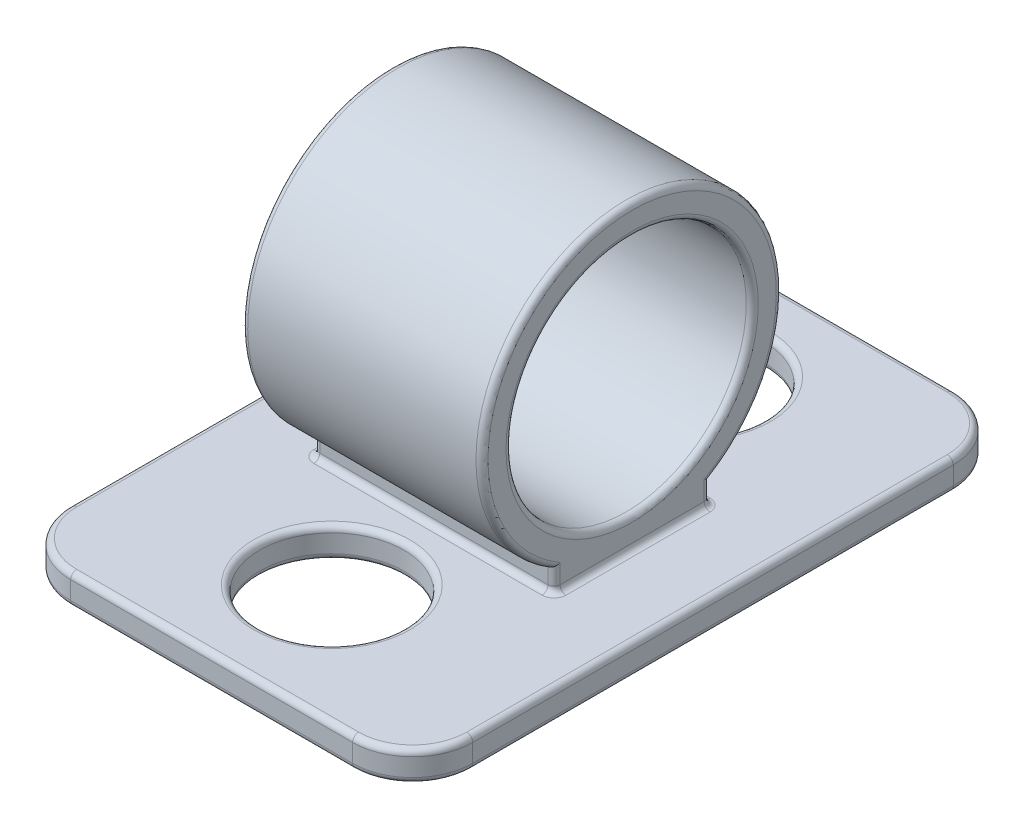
ISO-10303-21;
HEADER;
FILE_DESCRIPTION(('STEP AP214'),'2;1');
FILE_NAME('part.step','',(''),(''),'','','');
FILE_SCHEMA(('AUTOMOTIVE_DESIGN { 1 0 10303 214 1 1 1 1 }'));
ENDSEC;
DATA;
#1=APPLICATION_CONTEXT('core data for automotive mechanical design processes');
#2=APPLICATION_PROTOCOL_DEFINITION('international standard','automotive_design',2000,#1);
#3=PRODUCT_CONTEXT('',#1,'mechanical');
#4=PRODUCT('Part','Part','',(#3));
#5=PRODUCT_RELATED_PRODUCT_CATEGORY('part','',(#4));
#6=PRODUCT_DEFINITION_FORMATION('','',#4);
#7=PRODUCT_DEFINITION_CONTEXT('part definition',#1,'design');
#8=PRODUCT_DEFINITION('design','',#6,#7);
#9=PRODUCT_DEFINITION_SHAPE('','',#8);
#10=(LENGTH_UNIT() NAMED_UNIT(*) SI_UNIT(.MILLI.,.METRE.));
#11=(NAMED_UNIT(*) PLANE_ANGLE_UNIT() SI_UNIT($,.RADIAN.));
#12=(NAMED_UNIT(*) SI_UNIT($,.STERADIAN.) SOLID_ANGLE_UNIT());
#13=UNCERTAINTY_MEASURE_WITH_UNIT(LENGTH_MEASURE(1.E-05),#10,'distance_accuracy_value','');
#14=(GEOMETRIC_REPRESENTATION_CONTEXT(3) GLOBAL_UNCERTAINTY_ASSIGNED_CONTEXT((#13)) GLOBAL_UNIT_ASSIGNED_CONTEXT((#10,
#11,#12)) REPRESENTATION_CONTEXT('',''));
#15=CARTESIAN_POINT('',(0.,0.,0.));
#16=DIRECTION('',(0.,0.,1.));
#17=DIRECTION('',(1.,0.,0.));
#18=AXIS2_PLACEMENT_3D('',#15,#16,#17);
#19=CARTESIAN_POINT('',(0.,1.27,0.));
#20=DIRECTION('',(0.,1.,0.));
#21=DIRECTION('',(0.,0.,1.));
#22=AXIS2_PLACEMENT_3D('',#19,#20,#21);
#23=PLANE('',#22);
#24=CARTESIAN_POINT('',(-5.96,1.27,10.16));
#25=DIRECTION('',(0.,1.,0.));
#26=DIRECTION('',(0.,0.,1.));
#27=AXIS2_PLACEMENT_3D('',#24,#25,#26);
#28=CIRCLE('',#27,2.286);
#29=CARTESIAN_POINT('',(-5.96,1.27,12.446));
#30=VERTEX_POINT('',#29);
#31=CARTESIAN_POINT('',(-8.246,1.27,10.16));
#32=VERTEX_POINT('',#31);
#33=EDGE_CURVE('E797',#30,#32,#28,.F.);
#34=ORIENTED_EDGE('',*,*,#33,.F.);
#35=DIRECTION('',(1.,0.,0.));
#36=VECTOR('',#35,1.);
#37=CARTESIAN_POINT('',(8.5,1.27,12.446));
#38=LINE('',#37,#36);
#39=CARTESIAN_POINT('',(5.96,1.27,12.446));
#40=VERTEX_POINT('',#39);
#41=EDGE_CURVE('E720',#30,#40,#38,.T.);
#42=ORIENTED_EDGE('',*,*,#41,.T.);
#43=CARTESIAN_POINT('',(5.96,1.27,10.16));
#44=DIRECTION('',(0.,1.,0.));
#45=DIRECTION('',(0.,0.,1.));
#46=AXIS2_PLACEMENT_3D('',#43,#44,#45);
#47=CIRCLE('',#46,2.286);
#48=CARTESIAN_POINT('',(8.246,1.27,10.16));
#49=VERTEX_POINT('',#48);
#50=EDGE_CURVE('E718',#49,#40,#47,.F.);
#51=ORIENTED_EDGE('',*,*,#50,.F.);
#52=DIRECTION('',(0.,0.,-1.));
#53=VECTOR('',#52,1.);
#54=CARTESIAN_POINT('',(8.246,1.27,-12.7));
#55=LINE('',#54,#53);
#56=CARTESIAN_POINT('',(8.246,1.27,-10.16));
#57=VERTEX_POINT('',#56);
#58=EDGE_CURVE('E711',#49,#57,#55,.T.);
#59=ORIENTED_EDGE('',*,*,#58,.T.);
#60=CARTESIAN_POINT('',(5.96,1.27,-10.16));
#61=DIRECTION('',(0.,1.,0.));
#62=DIRECTION('',(0.,0.,1.));
#63=AXIS2_PLACEMENT_3D('',#60,#61,#62);
#64=CIRCLE('',#63,2.286);
#65=CARTESIAN_POINT('',(5.96,1.27,-12.446));
#66=VERTEX_POINT('',#65);
#67=EDGE_CURVE('E695',#66,#57,#64,.F.);
#68=ORIENTED_EDGE('',*,*,#67,.F.);
#69=DIRECTION('',(-1.,0.,0.));
#70=VECTOR('',#69,1.);
#71=CARTESIAN_POINT('',(-8.5,1.27,-12.446));
#72=LINE('',#71,#70);
#73=CARTESIAN_POINT('',(-5.96,1.27,-12.446));
#74=VERTEX_POINT('',#73);
#75=EDGE_CURVE('E707',#66,#74,#72,.T.);
#76=ORIENTED_EDGE('',*,*,#75,.T.);
#77=CARTESIAN_POINT('',(-5.96,1.27,-10.16));
#78=DIRECTION('',(0.,1.,0.));
#79=DIRECTION('',(0.,0.,1.));
#80=AXIS2_PLACEMENT_3D('',#77,#78,#79);
#81=CIRCLE('',#80,2.286);
#82=CARTESIAN_POINT('',(-8.246,1.27,-10.16));
#83=VERTEX_POINT('',#82);
#84=EDGE_CURVE('E709',#83,#74,#81,.F.);
#85=ORIENTED_EDGE('',*,*,#84,.F.);
#86=DIRECTION('',(0.,0.,1.));
#87=VECTOR('',#86,1.);
#88=CARTESIAN_POINT('',(-8.246,1.27,12.7));
#89=LINE('',#88,#87);
#90=EDGE_CURVE('E713',#83,#32,#89,.T.);
#91=ORIENTED_EDGE('',*,*,#90,.T.);
#92=EDGE_LOOP('',(#34,#42,#51,#59,#68,#76,#85,#91));
#93=FACE_BOUND('',#92,.T.);
#94=CARTESIAN_POINT('',(0.,1.27,-7.62));
#95=DIRECTION('',(0.,1.,0.));
#96=DIRECTION('',(0.,0.,1.));
#97=AXIS2_PLACEMENT_3D('',#94,#95,#96);
#98=CIRCLE('',#97,3.302);
#99=CARTESIAN_POINT('',(0.,1.27,-4.318));
#100=VERTEX_POINT('',#99);
#101=EDGE_CURVE('E614',#100,#100,#98,.F.);
#102=ORIENTED_EDGE('',*,*,#101,.T.);
#103=EDGE_LOOP('',(#102));
#104=FACE_BOUND('',#103,.T.);
#105=CARTESIAN_POINT('',(0.,1.27,7.62));
#106=DIRECTION('',(0.,1.,0.));
#107=DIRECTION('',(0.,0.,1.));
#108=AXIS2_PLACEMENT_3D('',#105,#106,#107);
#109=CIRCLE('',#108,3.302);
#110=CARTESIAN_POINT('',(0.,1.27,10.922));
#111=VERTEX_POINT('',#110);
#112=EDGE_CURVE('E609',#111,#111,#109,.F.);
#113=ORIENTED_EDGE('',*,*,#112,.T.);
#114=EDGE_LOOP('',(#113));
#115=FACE_BOUND('',#114,.T.);
#116=CARTESIAN_POINT('',(4.826,1.27,-3.048));
#117=DIRECTION('',(0.,1.,0.));
#118=DIRECTION('',(0.,0.,1.));
#119=AXIS2_PLACEMENT_3D('',#116,#117,#118);
#120=CIRCLE('',#119,0.508);
#121=CARTESIAN_POINT('',(5.334,1.27,-3.048));
#122=VERTEX_POINT('',#121);
#123=CARTESIAN_POINT('',(4.826,1.27,-3.556));
#124=VERTEX_POINT('',#123);
#125=EDGE_CURVE('E293',#122,#124,#120,.T.);
#126=ORIENTED_EDGE('',*,*,#125,.F.);
#127=DIRECTION('',(0.,0.,-1.));
#128=VECTOR('',#127,1.);
#129=CARTESIAN_POINT('',(5.334,1.27,3.302));
#130=LINE('',#129,#128);
#131=CARTESIAN_POINT('',(5.334,1.27,3.048));
#132=VERTEX_POINT('',#131);
#133=EDGE_CURVE('E291',#122,#132,#130,.F.);
#134=ORIENTED_EDGE('',*,*,#133,.T.);
#135=CARTESIAN_POINT('',(4.826,1.27,3.048));
#136=DIRECTION('',(0.,1.,0.));
#137=DIRECTION('',(0.,0.,1.));
#138=AXIS2_PLACEMENT_3D('',#135,#136,#137);
#139=CIRCLE('',#138,0.508);
#140=CARTESIAN_POINT('',(4.826,1.27,3.556));
#141=VERTEX_POINT('',#140);
#142=EDGE_CURVE('E288',#141,#132,#139,.T.);
#143=ORIENTED_EDGE('',*,*,#142,.F.);
#144=DIRECTION('',(-1.,0.,0.));
#145=VECTOR('',#144,1.);
#146=CARTESIAN_POINT('',(0.,1.27,3.556));
#147=LINE('',#146,#145);
#148=CARTESIAN_POINT('',(-4.826,1.27,3.556));
#149=VERTEX_POINT('',#148);
#150=EDGE_CURVE('E283',#141,#149,#147,.T.);
#151=ORIENTED_EDGE('',*,*,#150,.T.);
#152=CARTESIAN_POINT('',(-4.826,1.27,3.048));
#153=DIRECTION('',(0.,1.,0.));
#154=DIRECTION('',(0.,0.,1.));
#155=AXIS2_PLACEMENT_3D('',#152,#153,#154);
#156=CIRCLE('',#155,0.508);
#157=CARTESIAN_POINT('',(-5.334,1.27,3.048));
#158=VERTEX_POINT('',#157);
#159=EDGE_CURVE('E280',#158,#149,#156,.T.);
#160=ORIENTED_EDGE('',*,*,#159,.F.);
#161=DIRECTION('',(0.,0.,-1.));
#162=VECTOR('',#161,1.);
#163=CARTESIAN_POINT('',(-5.334,1.27,0.));
#164=LINE('',#163,#162);
#165=CARTESIAN_POINT('',(-5.334,1.27,-3.048));
#166=VERTEX_POINT('',#165);
#167=EDGE_CURVE('E277',#158,#166,#164,.T.);
#168=ORIENTED_EDGE('',*,*,#167,.T.);
#169=CARTESIAN_POINT('',(-4.826,1.27,-3.048));
#170=DIRECTION('',(0.,1.,0.));
#171=DIRECTION('',(0.,0.,1.));
#172=AXIS2_PLACEMENT_3D('',#169,#170,#171);
#173=CIRCLE('',#172,0.508);
#174=CARTESIAN_POINT('',(-4.826,1.27,-3.556));
#175=VERTEX_POINT('',#174);
#176=EDGE_CURVE('E274',#175,#166,#173,.T.);
#177=ORIENTED_EDGE('',*,*,#176,.F.);
#178=DIRECTION('',(1.,0.,0.));
#179=VECTOR('',#178,1.);
#180=CARTESIAN_POINT('',(0.,1.27,-3.556));
#181=LINE('',#180,#179);
#182=EDGE_CURVE('E285',#175,#124,#181,.T.);
#183=ORIENTED_EDGE('',*,*,#182,.T.);
#184=EDGE_LOOP('',(#126,#134,#143,#151,#160,#168,#177,#183));
#185=FACE_BOUND('',#184,.T.);
#186=ADVANCED_FACE('F34',(#93,#104,#115,#185),#23,.T.);
#187=CARTESIAN_POINT('',(0.,0.,0.));
#188=DIRECTION('',(0.,1.,0.));
#189=DIRECTION('',(0.,0.,1.));
#190=AXIS2_PLACEMENT_3D('',#187,#188,#189);
#191=PLANE('',#190);
#192=CARTESIAN_POINT('',(0.,0.,7.62));
#193=DIRECTION('',(0.,1.,0.));
#194=DIRECTION('',(0.,0.,1.));
#195=AXIS2_PLACEMENT_3D('',#192,#193,#194);
#196=CIRCLE('',#195,3.302);
#197=CARTESIAN_POINT('',(0.,0.,10.922));
#198=VERTEX_POINT('',#197);
#199=EDGE_CURVE('E788',#198,#198,#196,.T.);
#200=ORIENTED_EDGE('',*,*,#199,.T.);
#201=EDGE_LOOP('',(#200));
#202=FACE_BOUND('',#201,.T.);
#203=CARTESIAN_POINT('',(0.,0.,-7.62));
#204=DIRECTION('',(0.,1.,0.));
#205=DIRECTION('',(0.,0.,1.));
#206=AXIS2_PLACEMENT_3D('',#203,#204,#205);
#207=CIRCLE('',#206,3.302);
#208=CARTESIAN_POINT('',(0.,0.,-4.318));
#209=VERTEX_POINT('',#208);
#210=EDGE_CURVE('E785',#209,#209,#207,.T.);
#211=ORIENTED_EDGE('',*,*,#210,.T.);
#212=EDGE_LOOP('',(#211));
#213=FACE_BOUND('',#212,.T.);
#214=CARTESIAN_POINT('',(-5.96,0.,10.16));
#215=DIRECTION('',(0.,1.,0.));
#216=DIRECTION('',(0.,0.,1.));
#217=AXIS2_PLACEMENT_3D('',#214,#215,#216);
#218=CIRCLE('',#217,2.286);
#219=CARTESIAN_POINT('',(-8.246,0.,10.16));
#220=VERTEX_POINT('',#219);
#221=CARTESIAN_POINT('',(-5.96,0.,12.446));
#222=VERTEX_POINT('',#221);
#223=EDGE_CURVE('E778',#220,#222,#218,.T.);
#224=ORIENTED_EDGE('',*,*,#223,.F.);
#225=DIRECTION('',(0.,0.,1.));
#226=VECTOR('',#225,1.);
#227=CARTESIAN_POINT('',(-8.246,0.,0.));
#228=LINE('',#227,#226);
#229=CARTESIAN_POINT('',(-8.246,0.,-10.16));
#230=VERTEX_POINT('',#229);
#231=EDGE_CURVE('E783',#220,#230,#228,.F.);
#232=ORIENTED_EDGE('',*,*,#231,.T.);
#233=CARTESIAN_POINT('',(-5.96,0.,-10.16));
#234=DIRECTION('',(0.,1.,0.));
#235=DIRECTION('',(0.,0.,1.));
#236=AXIS2_PLACEMENT_3D('',#233,#234,#235);
#237=CIRCLE('',#236,2.286);
#238=CARTESIAN_POINT('',(-5.96,0.,-12.446));
#239=VERTEX_POINT('',#238);
#240=EDGE_CURVE('E780',#239,#230,#237,.T.);
#241=ORIENTED_EDGE('',*,*,#240,.F.);
#242=DIRECTION('',(-1.,0.,0.));
#243=VECTOR('',#242,1.);
#244=CARTESIAN_POINT('',(0.,0.,-12.446));
#245=LINE('',#244,#243);
#246=CARTESIAN_POINT('',(5.96,0.,-12.446));
#247=VERTEX_POINT('',#246);
#248=EDGE_CURVE('E775',#239,#247,#245,.F.);
#249=ORIENTED_EDGE('',*,*,#248,.T.);
#250=CARTESIAN_POINT('',(5.96,0.,-10.16));
#251=DIRECTION('',(0.,1.,0.));
#252=DIRECTION('',(0.,0.,1.));
#253=AXIS2_PLACEMENT_3D('',#250,#251,#252);
#254=CIRCLE('',#253,2.286);
#255=CARTESIAN_POINT('',(8.246,0.,-10.16));
#256=VERTEX_POINT('',#255);
#257=EDGE_CURVE('E247',#256,#247,#254,.T.);
#258=ORIENTED_EDGE('',*,*,#257,.F.);
#259=DIRECTION('',(0.,0.,-1.));
#260=VECTOR('',#259,1.);
#261=CARTESIAN_POINT('',(8.246,0.,0.));
#262=LINE('',#261,#260);
#263=CARTESIAN_POINT('',(8.246,0.,10.16));
#264=VERTEX_POINT('',#263);
#265=EDGE_CURVE('E231',#256,#264,#262,.F.);
#266=ORIENTED_EDGE('',*,*,#265,.T.);
#267=CARTESIAN_POINT('',(5.96,0.,10.16));
#268=DIRECTION('',(0.,1.,0.));
#269=DIRECTION('',(0.,0.,1.));
#270=AXIS2_PLACEMENT_3D('',#267,#268,#269);
#271=CIRCLE('',#270,2.286);
#272=CARTESIAN_POINT('',(5.96,0.,12.446));
#273=VERTEX_POINT('',#272);
#274=EDGE_CURVE('E225',#273,#264,#271,.T.);
#275=ORIENTED_EDGE('',*,*,#274,.F.);
#276=DIRECTION('',(1.,0.,0.));
#277=VECTOR('',#276,1.);
#278=CARTESIAN_POINT('',(0.,0.,12.446));
#279=LINE('',#278,#277);
#280=EDGE_CURVE('E228',#273,#222,#279,.F.);
#281=ORIENTED_EDGE('',*,*,#280,.T.);
#282=EDGE_LOOP('',(#224,#232,#241,#249,#258,#266,#275,#281));
#283=FACE_BOUND('',#282,.T.);
#284=ADVANCED_FACE('F227',(#202,#213,#283),#191,.F.);
#285=CARTESIAN_POINT('',(8.5,1.27,-12.7));
#286=DIRECTION('',(-1.,0.,0.));
#287=DIRECTION('',(0.,0.,1.));
#288=AXIS2_PLACEMENT_3D('',#285,#286,#287);
#289=PLANE('',#288);
#290=DIRECTION('',(0.,0.,-1.));
#291=VECTOR('',#290,1.);
#292=CARTESIAN_POINT('',(8.5,0.254,-12.7));
#293=LINE('',#292,#291);
#294=CARTESIAN_POINT('',(8.5,0.254,10.16));
#295=VERTEX_POINT('',#294);
#296=CARTESIAN_POINT('',(8.5,0.254,-10.16));
#297=VERTEX_POINT('',#296);
#298=EDGE_CURVE('E648',#295,#297,#293,.T.);
#299=ORIENTED_EDGE('',*,*,#298,.T.);
#300=DIRECTION('',(0.,-1.,0.));
#301=VECTOR('',#300,1.);
#302=CARTESIAN_POINT('',(8.5,1.27,-10.16));
#303=LINE('',#302,#301);
#304=CARTESIAN_POINT('',(8.5,1.016,-10.16));
#305=VERTEX_POINT('',#304);
#306=EDGE_CURVE('E278',#297,#305,#303,.F.);
#307=ORIENTED_EDGE('',*,*,#306,.T.);
#308=DIRECTION('',(0.,0.,-1.));
#309=VECTOR('',#308,1.);
#310=CARTESIAN_POINT('',(8.5,1.016,12.7));
#311=LINE('',#310,#309);
#312=CARTESIAN_POINT('',(8.5,1.016,10.16));
#313=VERTEX_POINT('',#312);
#314=EDGE_CURVE('E646',#305,#313,#311,.F.);
#315=ORIENTED_EDGE('',*,*,#314,.T.);
#316=DIRECTION('',(0.,-1.,0.));
#317=VECTOR('',#316,1.);
#318=CARTESIAN_POINT('',(8.5,1.27,10.16));
#319=LINE('',#318,#317);
#320=EDGE_CURVE('E644',#313,#295,#319,.T.);
#321=ORIENTED_EDGE('',*,*,#320,.T.);
#322=EDGE_LOOP('',(#299,#307,#315,#321));
#323=FACE_BOUND('',#322,.T.);
#324=ADVANCED_FACE('F441',(#323),#289,.F.);
#325=CARTESIAN_POINT('',(-8.5,1.27,-12.7));
#326=DIRECTION('',(0.,0.,1.));
#327=DIRECTION('',(1.,0.,0.));
#328=AXIS2_PLACEMENT_3D('',#325,#326,#327);
#329=PLANE('',#328);
#330=DIRECTION('',(-1.,0.,0.));
#331=VECTOR('',#330,1.);
#332=CARTESIAN_POINT('',(-8.5,0.254,-12.7));
#333=LINE('',#332,#331);
#334=CARTESIAN_POINT('',(5.96,0.254,-12.7));
#335=VERTEX_POINT('',#334);
#336=CARTESIAN_POINT('',(-5.96,0.254,-12.7));
#337=VERTEX_POINT('',#336);
#338=EDGE_CURVE('E621',#335,#337,#333,.T.);
#339=ORIENTED_EDGE('',*,*,#338,.T.);
#340=DIRECTION('',(0.,-1.,0.));
#341=VECTOR('',#340,1.);
#342=CARTESIAN_POINT('',(-5.96,1.27,-12.7));
#343=LINE('',#342,#341);
#344=CARTESIAN_POINT('',(-5.96,1.016,-12.7));
#345=VERTEX_POINT('',#344);
#346=EDGE_CURVE('E624',#337,#345,#343,.F.);
#347=ORIENTED_EDGE('',*,*,#346,.T.);
#348=DIRECTION('',(-1.,0.,0.));
#349=VECTOR('',#348,1.);
#350=CARTESIAN_POINT('',(8.5,1.016,-12.7));
#351=LINE('',#350,#349);
#352=CARTESIAN_POINT('',(5.96,1.016,-12.7));
#353=VERTEX_POINT('',#352);
#354=EDGE_CURVE('E619',#345,#353,#351,.F.);
#355=ORIENTED_EDGE('',*,*,#354,.T.);
#356=DIRECTION('',(0.,-1.,0.));
#357=VECTOR('',#356,1.);
#358=CARTESIAN_POINT('',(5.96,1.27,-12.7));
#359=LINE('',#358,#357);
#360=EDGE_CURVE('E611',#353,#335,#359,.T.);
#361=ORIENTED_EDGE('',*,*,#360,.T.);
#362=EDGE_LOOP('',(#339,#347,#355,#361));
#363=FACE_BOUND('',#362,.T.);
#364=ADVANCED_FACE('F456',(#363),#329,.F.);
#365=CARTESIAN_POINT('',(-8.5,1.27,-12.7));
#366=DIRECTION('',(1.,0.,0.));
#367=DIRECTION('',(0.,0.,-1.));
#368=AXIS2_PLACEMENT_3D('',#365,#366,#367);
#369=PLANE('',#368);
#370=DIRECTION('',(0.,0.,1.));
#371=VECTOR('',#370,1.);
#372=CARTESIAN_POINT('',(-8.5,1.016,-12.7));
#373=LINE('',#372,#371);
#374=CARTESIAN_POINT('',(-8.5,1.016,10.16));
#375=VERTEX_POINT('',#374);
#376=CARTESIAN_POINT('',(-8.5,1.016,-10.16));
#377=VERTEX_POINT('',#376);
#378=EDGE_CURVE('E628',#375,#377,#373,.F.);
#379=ORIENTED_EDGE('',*,*,#378,.T.);
#380=DIRECTION('',(0.,-1.,0.));
#381=VECTOR('',#380,1.);
#382=CARTESIAN_POINT('',(-8.5,1.27,-10.16));
#383=LINE('',#382,#381);
#384=CARTESIAN_POINT('',(-8.5,0.254,-10.16));
#385=VERTEX_POINT('',#384);
#386=EDGE_CURVE('E633',#377,#385,#383,.T.);
#387=ORIENTED_EDGE('',*,*,#386,.T.);
#388=DIRECTION('',(0.,0.,1.));
#389=VECTOR('',#388,1.);
#390=CARTESIAN_POINT('',(-8.5,0.254,-12.7));
#391=LINE('',#390,#389);
#392=CARTESIAN_POINT('',(-8.5,0.254,10.16));
#393=VERTEX_POINT('',#392);
#394=EDGE_CURVE('E630',#385,#393,#391,.T.);
#395=ORIENTED_EDGE('',*,*,#394,.T.);
#396=DIRECTION('',(0.,-1.,0.));
#397=VECTOR('',#396,1.);
#398=CARTESIAN_POINT('',(-8.5,1.27,10.16));
#399=LINE('',#398,#397);
#400=EDGE_CURVE('E626',#393,#375,#399,.F.);
#401=ORIENTED_EDGE('',*,*,#400,.T.);
#402=EDGE_LOOP('',(#379,#387,#395,#401));
#403=FACE_BOUND('',#402,.T.);
#404=ADVANCED_FACE('F452',(#403),#369,.F.);
#405=CARTESIAN_POINT('',(-8.5,1.27,12.7));
#406=DIRECTION('',(0.,0.,-1.));
#407=DIRECTION('',(-1.,0.,0.));
#408=AXIS2_PLACEMENT_3D('',#405,#406,#407);
#409=PLANE('',#408);
#410=DIRECTION('',(1.,0.,0.));
#411=VECTOR('',#410,1.);
#412=CARTESIAN_POINT('',(-8.5,1.016,12.7));
#413=LINE('',#412,#411);
#414=CARTESIAN_POINT('',(5.96,1.016,12.7));
#415=VERTEX_POINT('',#414);
#416=CARTESIAN_POINT('',(-5.96,1.016,12.7));
#417=VERTEX_POINT('',#416);
#418=EDGE_CURVE('E637',#415,#417,#413,.F.);
#419=ORIENTED_EDGE('',*,*,#418,.T.);
#420=DIRECTION('',(0.,-1.,0.));
#421=VECTOR('',#420,1.);
#422=CARTESIAN_POINT('',(-5.96,1.27,12.7));
#423=LINE('',#422,#421);
#424=CARTESIAN_POINT('',(-5.96,0.254,12.7));
#425=VERTEX_POINT('',#424);
#426=EDGE_CURVE('E642',#417,#425,#423,.T.);
#427=ORIENTED_EDGE('',*,*,#426,.T.);
#428=DIRECTION('',(1.,0.,0.));
#429=VECTOR('',#428,1.);
#430=CARTESIAN_POINT('',(-8.5,0.254,12.7));
#431=LINE('',#430,#429);
#432=CARTESIAN_POINT('',(5.96,0.254,12.7));
#433=VERTEX_POINT('',#432);
#434=EDGE_CURVE('E639',#425,#433,#431,.T.);
#435=ORIENTED_EDGE('',*,*,#434,.T.);
#436=DIRECTION('',(0.,-1.,0.));
#437=VECTOR('',#436,1.);
#438=CARTESIAN_POINT('',(5.96,1.27,12.7));
#439=LINE('',#438,#437);
#440=EDGE_CURVE('E635',#433,#415,#439,.F.);
#441=ORIENTED_EDGE('',*,*,#440,.T.);
#442=EDGE_LOOP('',(#419,#427,#435,#441));
#443=FACE_BOUND('',#442,.T.);
#444=ADVANCED_FACE('F449',(#443),#409,.F.);
#445=CARTESIAN_POINT('',(0.,1.27,7.62));
#446=DIRECTION('',(0.,-1.,0.));
#447=DIRECTION('',(0.,0.,-1.));
#448=AXIS2_PLACEMENT_3D('',#445,#446,#447);
#449=CYLINDRICAL_SURFACE('',#448,3.048);
#450=CARTESIAN_POINT('',(0.,0.254,7.62));
#451=DIRECTION('',(0.,1.,0.));
#452=DIRECTION('',(0.,0.,1.));
#453=AXIS2_PLACEMENT_3D('',#450,#451,#452);
#454=CIRCLE('',#453,3.048);
#455=CARTESIAN_POINT('',(0.,0.254,10.668));
#456=VERTEX_POINT('',#455);
#457=EDGE_CURVE('E794',#456,#456,#454,.F.);
#458=ORIENTED_EDGE('',*,*,#457,.T.);
#459=EDGE_LOOP('',(#458));
#460=FACE_BOUND('',#459,.T.);
#461=CARTESIAN_POINT('',(0.,1.016,7.62));
#462=DIRECTION('',(0.,1.,0.));
#463=DIRECTION('',(0.,0.,1.));
#464=AXIS2_PLACEMENT_3D('',#461,#462,#463);
#465=CIRCLE('',#464,3.048);
#466=CARTESIAN_POINT('',(0.,1.016,10.668));
#467=VERTEX_POINT('',#466);
#468=EDGE_CURVE('E791',#467,#467,#465,.T.);
#469=ORIENTED_EDGE('',*,*,#468,.T.);
#470=EDGE_LOOP('',(#469));
#471=FACE_BOUND('',#470,.T.);
#472=ADVANCED_FACE('F446',(#460,#471),#449,.F.);
#473=CARTESIAN_POINT('',(0.,1.27,-7.62));
#474=DIRECTION('',(0.,-1.,0.));
#475=DIRECTION('',(0.,0.,-1.));
#476=AXIS2_PLACEMENT_3D('',#473,#474,#475);
#477=CYLINDRICAL_SURFACE('',#476,3.048);
#478=CARTESIAN_POINT('',(0.,0.254,-7.62));
#479=DIRECTION('',(0.,1.,0.));
#480=DIRECTION('',(0.,0.,1.));
#481=AXIS2_PLACEMENT_3D('',#478,#479,#480);
#482=CIRCLE('',#481,3.048);
#483=CARTESIAN_POINT('',(0.,0.254,-4.572));
#484=VERTEX_POINT('',#483);
#485=EDGE_CURVE('E604',#484,#484,#482,.F.);
#486=ORIENTED_EDGE('',*,*,#485,.T.);
#487=EDGE_LOOP('',(#486));
#488=FACE_BOUND('',#487,.T.);
#489=CARTESIAN_POINT('',(0.,1.016,-7.62));
#490=DIRECTION('',(0.,1.,0.));
#491=DIRECTION('',(0.,0.,1.));
#492=AXIS2_PLACEMENT_3D('',#489,#490,#491);
#493=CIRCLE('',#492,3.048);
#494=CARTESIAN_POINT('',(0.,1.016,-4.572));
#495=VERTEX_POINT('',#494);
#496=EDGE_CURVE('E607',#495,#495,#493,.T.);
#497=ORIENTED_EDGE('',*,*,#496,.T.);
#498=EDGE_LOOP('',(#497));
#499=FACE_BOUND('',#498,.T.);
#500=ADVANCED_FACE('F468',(#488,#499),#477,.F.);
#501=CARTESIAN_POINT('',(0.,0.254,7.62));
#502=DIRECTION('',(0.,1.,0.));
#503=DIRECTION('',(0.,0.,1.));
#504=AXIS2_PLACEMENT_3D('',#501,#502,#503);
#505=TOROIDAL_SURFACE('',#504,3.302,0.254);
#506=ORIENTED_EDGE('',*,*,#457,.F.);
#507=EDGE_LOOP('',(#506));
#508=FACE_BOUND('',#507,.T.);
#509=ORIENTED_EDGE('',*,*,#199,.F.);
#510=EDGE_LOOP('',(#509));
#511=FACE_BOUND('',#510,.T.);
#512=ADVANCED_FACE('F464',(#508,#511),#505,.T.);
#513=CARTESIAN_POINT('',(0.,1.016,7.62));
#514=DIRECTION('',(0.,1.,0.));
#515=DIRECTION('',(0.,0.,1.));
#516=AXIS2_PLACEMENT_3D('',#513,#514,#515);
#517=TOROIDAL_SURFACE('',#516,3.302,0.254);
#518=ORIENTED_EDGE('',*,*,#112,.F.);
#519=EDGE_LOOP('',(#518));
#520=FACE_BOUND('',#519,.T.);
#521=ORIENTED_EDGE('',*,*,#468,.F.);
#522=EDGE_LOOP('',(#521));
#523=FACE_BOUND('',#522,.T.);
#524=ADVANCED_FACE('F467',(#520,#523),#517,.T.);
#525=CARTESIAN_POINT('',(0.,0.254,-7.62));
#526=DIRECTION('',(0.,1.,0.));
#527=DIRECTION('',(0.,0.,1.));
#528=AXIS2_PLACEMENT_3D('',#525,#526,#527);
#529=TOROIDAL_SURFACE('',#528,3.302,0.254);
#530=ORIENTED_EDGE('',*,*,#485,.F.);
#531=EDGE_LOOP('',(#530));
#532=FACE_BOUND('',#531,.T.);
#533=ORIENTED_EDGE('',*,*,#210,.F.);
#534=EDGE_LOOP('',(#533));
#535=FACE_BOUND('',#534,.T.);
#536=ADVANCED_FACE('F472',(#532,#535),#529,.T.);
#537=CARTESIAN_POINT('',(0.,1.016,-7.62));
#538=DIRECTION('',(0.,1.,0.));
#539=DIRECTION('',(0.,0.,1.));
#540=AXIS2_PLACEMENT_3D('',#537,#538,#539);
#541=TOROIDAL_SURFACE('',#540,3.302,0.254);
#542=ORIENTED_EDGE('',*,*,#101,.F.);
#543=EDGE_LOOP('',(#542));
#544=FACE_BOUND('',#543,.T.);
#545=ORIENTED_EDGE('',*,*,#496,.F.);
#546=EDGE_LOOP('',(#545));
#547=FACE_BOUND('',#546,.T.);
#548=ADVANCED_FACE('F476',(#544,#547),#541,.T.);
#549=CARTESIAN_POINT('',(0.,1.016,12.446));
#550=DIRECTION('',(-1.,0.,0.));
#551=DIRECTION('',(0.,0.,1.));
#552=AXIS2_PLACEMENT_3D('',#549,#550,#551);
#553=CYLINDRICAL_SURFACE('',#552,0.254);
#554=CARTESIAN_POINT('',(5.96,1.016,12.446));
#555=DIRECTION('',(1.,0.,0.));
#556=DIRECTION('',(0.,0.,-1.));
#557=AXIS2_PLACEMENT_3D('',#554,#555,#556);
#558=CIRCLE('',#557,0.254);
#559=EDGE_CURVE('E236',#40,#415,#558,.T.);
#560=ORIENTED_EDGE('',*,*,#559,.F.);
#561=ORIENTED_EDGE('',*,*,#41,.F.);
#562=CARTESIAN_POINT('',(-5.96,1.016,12.446));
#563=DIRECTION('',(-1.,0.,0.));
#564=DIRECTION('',(0.,0.,1.));
#565=AXIS2_PLACEMENT_3D('',#562,#563,#564);
#566=CIRCLE('',#565,0.254);
#567=EDGE_CURVE('E269',#417,#30,#566,.T.);
#568=ORIENTED_EDGE('',*,*,#567,.F.);
#569=ORIENTED_EDGE('',*,*,#418,.F.);
#570=EDGE_LOOP('',(#560,#561,#568,#569));
#571=FACE_BOUND('',#570,.T.);
#572=ADVANCED_FACE('F480',(#571),#553,.T.);
#573=CARTESIAN_POINT('',(5.96,1.016,10.16));
#574=DIRECTION('',(0.,1.,0.));
#575=DIRECTION('',(0.,0.,1.));
#576=AXIS2_PLACEMENT_3D('',#573,#574,#575);
#577=TOROIDAL_SURFACE('',#576,2.286,0.254);
#578=ORIENTED_EDGE('',*,*,#50,.T.);
#579=ORIENTED_EDGE('',*,*,#559,.T.);
#580=CARTESIAN_POINT('',(5.96,1.016,10.16));
#581=DIRECTION('',(0.,1.,0.));
#582=DIRECTION('',(0.,0.,1.));
#583=AXIS2_PLACEMENT_3D('',#580,#581,#582);
#584=CIRCLE('',#583,2.54);
#585=EDGE_CURVE('E266',#313,#415,#584,.F.);
#586=ORIENTED_EDGE('',*,*,#585,.F.);
#587=CARTESIAN_POINT('',(8.246,1.016,10.16));
#588=DIRECTION('',(0.,0.,1.));
#589=DIRECTION('',(1.,0.,0.));
#590=AXIS2_PLACEMENT_3D('',#587,#588,#589);
#591=CIRCLE('',#590,0.254);
#592=EDGE_CURVE('E263',#49,#313,#591,.F.);
#593=ORIENTED_EDGE('',*,*,#592,.F.);
#594=EDGE_LOOP('',(#578,#579,#586,#593));
#595=FACE_BOUND('',#594,.T.);
#596=ADVANCED_FACE('F550',(#595),#577,.T.);
#597=CARTESIAN_POINT('',(-5.96,1.016,10.16));
#598=DIRECTION('',(0.,1.,0.));
#599=DIRECTION('',(0.,0.,1.));
#600=AXIS2_PLACEMENT_3D('',#597,#598,#599);
#601=TOROIDAL_SURFACE('',#600,2.286,0.254);
#602=ORIENTED_EDGE('',*,*,#567,.T.);
#603=ORIENTED_EDGE('',*,*,#33,.T.);
#604=CARTESIAN_POINT('',(-8.246,1.016,10.16));
#605=DIRECTION('',(0.,0.,1.));
#606=DIRECTION('',(1.,0.,0.));
#607=AXIS2_PLACEMENT_3D('',#604,#605,#606);
#608=CIRCLE('',#607,0.254);
#609=EDGE_CURVE('E255',#375,#32,#608,.F.);
#610=ORIENTED_EDGE('',*,*,#609,.F.);
#611=CARTESIAN_POINT('',(-5.96,1.016,10.16));
#612=DIRECTION('',(0.,1.,0.));
#613=DIRECTION('',(0.,0.,1.));
#614=AXIS2_PLACEMENT_3D('',#611,#612,#613);
#615=CIRCLE('',#614,2.54);
#616=EDGE_CURVE('E252',#417,#375,#615,.F.);
#617=ORIENTED_EDGE('',*,*,#616,.F.);
#618=EDGE_LOOP('',(#602,#603,#610,#617));
#619=FACE_BOUND('',#618,.T.);
#620=ADVANCED_FACE('F546',(#619),#601,.T.);
#621=CARTESIAN_POINT('',(5.96,1.27,10.16));
#622=DIRECTION('',(0.,-1.,0.));
#623=DIRECTION('',(0.,0.,-1.));
#624=AXIS2_PLACEMENT_3D('',#621,#622,#623);
#625=CYLINDRICAL_SURFACE('',#624,2.54);
#626=ORIENTED_EDGE('',*,*,#585,.T.);
#627=ORIENTED_EDGE('',*,*,#440,.F.);
#628=CARTESIAN_POINT('',(5.96,0.254,10.16));
#629=DIRECTION('',(0.,1.,0.));
#630=DIRECTION('',(0.,0.,1.));
#631=AXIS2_PLACEMENT_3D('',#628,#629,#630);
#632=CIRCLE('',#631,2.54);
#633=EDGE_CURVE('E251',#295,#433,#632,.F.);
#634=ORIENTED_EDGE('',*,*,#633,.F.);
#635=ORIENTED_EDGE('',*,*,#320,.F.);
#636=EDGE_LOOP('',(#626,#627,#634,#635));
#637=FACE_BOUND('',#636,.T.);
#638=ADVANCED_FACE('F542',(#637),#625,.T.);
#639=CARTESIAN_POINT('',(8.246,1.016,0.));
#640=DIRECTION('',(0.,0.,1.));
#641=DIRECTION('',(1.,0.,0.));
#642=AXIS2_PLACEMENT_3D('',#639,#640,#641);
#643=CYLINDRICAL_SURFACE('',#642,0.254);
#644=ORIENTED_EDGE('',*,*,#592,.T.);
#645=ORIENTED_EDGE('',*,*,#314,.F.);
#646=CARTESIAN_POINT('',(8.246,1.016,-10.16));
#647=DIRECTION('',(0.,0.,-1.));
#648=DIRECTION('',(-1.,0.,0.));
#649=AXIS2_PLACEMENT_3D('',#646,#647,#648);
#650=CIRCLE('',#649,0.254);
#651=EDGE_CURVE('E257',#57,#305,#650,.T.);
#652=ORIENTED_EDGE('',*,*,#651,.F.);
#653=ORIENTED_EDGE('',*,*,#58,.F.);
#654=EDGE_LOOP('',(#644,#645,#652,#653));
#655=FACE_BOUND('',#654,.T.);
#656=ADVANCED_FACE('F538',(#655),#643,.T.);
#657=CARTESIAN_POINT('',(0.,1.016,-12.446));
#658=DIRECTION('',(1.,0.,0.));
#659=DIRECTION('',(0.,0.,-1.));
#660=AXIS2_PLACEMENT_3D('',#657,#658,#659);
#661=CYLINDRICAL_SURFACE('',#660,0.254);
#662=CARTESIAN_POINT('',(-5.96,1.016,-12.446));
#663=DIRECTION('',(-1.,0.,0.));
#664=DIRECTION('',(0.,0.,1.));
#665=AXIS2_PLACEMENT_3D('',#662,#663,#664);
#666=CIRCLE('',#665,0.254);
#667=EDGE_CURVE('E685',#74,#345,#666,.T.);
#668=ORIENTED_EDGE('',*,*,#667,.F.);
#669=ORIENTED_EDGE('',*,*,#75,.F.);
#670=CARTESIAN_POINT('',(5.96,1.016,-12.446));
#671=DIRECTION('',(1.,0.,0.));
#672=DIRECTION('',(0.,0.,-1.));
#673=AXIS2_PLACEMENT_3D('',#670,#671,#672);
#674=CIRCLE('',#673,0.254);
#675=EDGE_CURVE('E688',#353,#66,#674,.T.);
#676=ORIENTED_EDGE('',*,*,#675,.F.);
#677=ORIENTED_EDGE('',*,*,#354,.F.);
#678=EDGE_LOOP('',(#668,#669,#676,#677));
#679=FACE_BOUND('',#678,.T.);
#680=ADVANCED_FACE('F534',(#679),#661,.T.);
#681=CARTESIAN_POINT('',(-8.246,1.016,0.));
#682=DIRECTION('',(0.,0.,-1.));
#683=DIRECTION('',(-1.,0.,0.));
#684=AXIS2_PLACEMENT_3D('',#681,#682,#683);
#685=CYLINDRICAL_SURFACE('',#684,0.254);
#686=ORIENTED_EDGE('',*,*,#609,.T.);
#687=ORIENTED_EDGE('',*,*,#90,.F.);
#688=CARTESIAN_POINT('',(-8.246,1.016,-10.16));
#689=DIRECTION('',(0.,0.,-1.));
#690=DIRECTION('',(-1.,0.,0.));
#691=AXIS2_PLACEMENT_3D('',#688,#689,#690);
#692=CIRCLE('',#691,0.254);
#693=EDGE_CURVE('E682',#377,#83,#692,.T.);
#694=ORIENTED_EDGE('',*,*,#693,.F.);
#695=ORIENTED_EDGE('',*,*,#378,.F.);
#696=EDGE_LOOP('',(#686,#687,#694,#695));
#697=FACE_BOUND('',#696,.T.);
#698=ADVANCED_FACE('F530',(#697),#685,.T.);
#699=CARTESIAN_POINT('',(-5.96,1.27,10.16));
#700=DIRECTION('',(0.,-1.,0.));
#701=DIRECTION('',(0.,0.,-1.));
#702=AXIS2_PLACEMENT_3D('',#699,#700,#701);
#703=CYLINDRICAL_SURFACE('',#702,2.54);
#704=ORIENTED_EDGE('',*,*,#616,.T.);
#705=ORIENTED_EDGE('',*,*,#400,.F.);
#706=CARTESIAN_POINT('',(-5.96,0.254,10.16));
#707=DIRECTION('',(0.,1.,0.));
#708=DIRECTION('',(0.,0.,1.));
#709=AXIS2_PLACEMENT_3D('',#706,#707,#708);
#710=CIRCLE('',#709,2.54);
#711=EDGE_CURVE('E679',#425,#393,#710,.F.);
#712=ORIENTED_EDGE('',*,*,#711,.F.);
#713=ORIENTED_EDGE('',*,*,#426,.F.);
#714=EDGE_LOOP('',(#704,#705,#712,#713));
#715=FACE_BOUND('',#714,.T.);
#716=ADVANCED_FACE('F527',(#715),#703,.T.);
#717=CARTESIAN_POINT('',(-8.5,0.254,12.446));
#718=DIRECTION('',(1.,0.,0.));
#719=DIRECTION('',(0.,0.,-1.));
#720=AXIS2_PLACEMENT_3D('',#717,#718,#719);
#721=CYLINDRICAL_SURFACE('',#720,0.254);
#722=CARTESIAN_POINT('',(-5.96,0.254,12.446));
#723=DIRECTION('',(-1.,0.,0.));
#724=DIRECTION('',(0.,0.,1.));
#725=AXIS2_PLACEMENT_3D('',#722,#723,#724);
#726=CIRCLE('',#725,0.254);
#727=EDGE_CURVE('E245',#222,#425,#726,.T.);
#728=ORIENTED_EDGE('',*,*,#727,.F.);
#729=ORIENTED_EDGE('',*,*,#280,.F.);
#730=CARTESIAN_POINT('',(5.96,0.254,12.446));
#731=DIRECTION('',(1.,0.,0.));
#732=DIRECTION('',(0.,0.,-1.));
#733=AXIS2_PLACEMENT_3D('',#730,#731,#732);
#734=CIRCLE('',#733,0.254);
#735=EDGE_CURVE('E242',#433,#273,#734,.T.);
#736=ORIENTED_EDGE('',*,*,#735,.F.);
#737=ORIENTED_EDGE('',*,*,#434,.F.);
#738=EDGE_LOOP('',(#728,#729,#736,#737));
#739=FACE_BOUND('',#738,.T.);
#740=ADVANCED_FACE('F240',(#739),#721,.T.);
#741=CARTESIAN_POINT('',(5.96,0.254,10.16));
#742=DIRECTION('',(0.,1.,0.));
#743=DIRECTION('',(0.,0.,1.));
#744=AXIS2_PLACEMENT_3D('',#741,#742,#743);
#745=TOROIDAL_SURFACE('',#744,2.286,0.254);
#746=ORIENTED_EDGE('',*,*,#735,.T.);
#747=ORIENTED_EDGE('',*,*,#274,.T.);
#748=CARTESIAN_POINT('',(8.246,0.254,10.16));
#749=DIRECTION('',(0.,0.,1.));
#750=DIRECTION('',(1.,0.,0.));
#751=AXIS2_PLACEMENT_3D('',#748,#749,#750);
#752=CIRCLE('',#751,0.254);
#753=EDGE_CURVE('E676',#295,#264,#752,.F.);
#754=ORIENTED_EDGE('',*,*,#753,.F.);
#755=ORIENTED_EDGE('',*,*,#633,.T.);
#756=EDGE_LOOP('',(#746,#747,#754,#755));
#757=FACE_BOUND('',#756,.T.);
#758=ADVANCED_FACE('F249',(#757),#745,.T.);
#759=CARTESIAN_POINT('',(5.96,1.016,-10.16));
#760=DIRECTION('',(0.,1.,0.));
#761=DIRECTION('',(0.,0.,1.));
#762=AXIS2_PLACEMENT_3D('',#759,#760,#761);
#763=TOROIDAL_SURFACE('',#762,2.286,0.254);
#764=ORIENTED_EDGE('',*,*,#67,.T.);
#765=ORIENTED_EDGE('',*,*,#651,.T.);
#766=CARTESIAN_POINT('',(5.96,1.016,-10.16));
#767=DIRECTION('',(0.,1.,0.));
#768=DIRECTION('',(0.,0.,1.));
#769=AXIS2_PLACEMENT_3D('',#766,#767,#768);
#770=CIRCLE('',#769,2.54);
#771=EDGE_CURVE('E673',#353,#305,#770,.F.);
#772=ORIENTED_EDGE('',*,*,#771,.F.);
#773=ORIENTED_EDGE('',*,*,#675,.T.);
#774=EDGE_LOOP('',(#764,#765,#772,#773));
#775=FACE_BOUND('',#774,.T.);
#776=ADVANCED_FACE('F518',(#775),#763,.T.);
#777=CARTESIAN_POINT('',(-5.96,1.016,-10.16));
#778=DIRECTION('',(0.,1.,0.));
#779=DIRECTION('',(0.,0.,1.));
#780=AXIS2_PLACEMENT_3D('',#777,#778,#779);
#781=TOROIDAL_SURFACE('',#780,2.286,0.254);
#782=ORIENTED_EDGE('',*,*,#84,.T.);
#783=ORIENTED_EDGE('',*,*,#667,.T.);
#784=CARTESIAN_POINT('',(-5.96,1.016,-10.16));
#785=DIRECTION('',(0.,1.,0.));
#786=DIRECTION('',(0.,0.,1.));
#787=AXIS2_PLACEMENT_3D('',#784,#785,#786);
#788=CIRCLE('',#787,2.54);
#789=EDGE_CURVE('E670',#377,#345,#788,.F.);
#790=ORIENTED_EDGE('',*,*,#789,.F.);
#791=ORIENTED_EDGE('',*,*,#693,.T.);
#792=EDGE_LOOP('',(#782,#783,#790,#791));
#793=FACE_BOUND('',#792,.T.);
#794=ADVANCED_FACE('F514',(#793),#781,.T.);
#795=CARTESIAN_POINT('',(-5.96,0.254,10.16));
#796=DIRECTION('',(0.,1.,0.));
#797=DIRECTION('',(0.,0.,1.));
#798=AXIS2_PLACEMENT_3D('',#795,#796,#797);
#799=TOROIDAL_SURFACE('',#798,2.286,0.254);
#800=ORIENTED_EDGE('',*,*,#727,.T.);
#801=ORIENTED_EDGE('',*,*,#711,.T.);
#802=CARTESIAN_POINT('',(-8.246,0.254,10.16));
#803=DIRECTION('',(0.,0.,1.));
#804=DIRECTION('',(1.,0.,0.));
#805=AXIS2_PLACEMENT_3D('',#802,#803,#804);
#806=CIRCLE('',#805,0.254);
#807=EDGE_CURVE('E668',#220,#393,#806,.F.);
#808=ORIENTED_EDGE('',*,*,#807,.F.);
#809=ORIENTED_EDGE('',*,*,#223,.T.);
#810=EDGE_LOOP('',(#800,#801,#808,#809));
#811=FACE_BOUND('',#810,.T.);
#812=ADVANCED_FACE('F510',(#811),#799,.T.);
#813=CARTESIAN_POINT('',(8.246,0.254,-12.7));
#814=DIRECTION('',(0.,0.,-1.));
#815=DIRECTION('',(-1.,0.,0.));
#816=AXIS2_PLACEMENT_3D('',#813,#814,#815);
#817=CYLINDRICAL_SURFACE('',#816,0.254);
#818=ORIENTED_EDGE('',*,*,#753,.T.);
#819=ORIENTED_EDGE('',*,*,#265,.F.);
#820=CARTESIAN_POINT('',(8.246,0.254,-10.16));
#821=DIRECTION('',(0.,0.,-1.));
#822=DIRECTION('',(-1.,0.,0.));
#823=AXIS2_PLACEMENT_3D('',#820,#821,#822);
#824=CIRCLE('',#823,0.254);
#825=EDGE_CURVE('E665',#297,#256,#824,.T.);
#826=ORIENTED_EDGE('',*,*,#825,.F.);
#827=ORIENTED_EDGE('',*,*,#298,.F.);
#828=EDGE_LOOP('',(#818,#819,#826,#827));
#829=FACE_BOUND('',#828,.T.);
#830=ADVANCED_FACE('F506',(#829),#817,.T.);
#831=CARTESIAN_POINT('',(5.96,1.27,-10.16));
#832=DIRECTION('',(0.,-1.,0.));
#833=DIRECTION('',(0.,0.,-1.));
#834=AXIS2_PLACEMENT_3D('',#831,#832,#833);
#835=CYLINDRICAL_SURFACE('',#834,2.54);
#836=ORIENTED_EDGE('',*,*,#771,.T.);
#837=ORIENTED_EDGE('',*,*,#306,.F.);
#838=CARTESIAN_POINT('',(5.96,0.254,-10.16));
#839=DIRECTION('',(0.,1.,0.));
#840=DIRECTION('',(0.,0.,1.));
#841=AXIS2_PLACEMENT_3D('',#838,#839,#840);
#842=CIRCLE('',#841,2.54);
#843=EDGE_CURVE('E663',#335,#297,#842,.F.);
#844=ORIENTED_EDGE('',*,*,#843,.F.);
#845=ORIENTED_EDGE('',*,*,#360,.F.);
#846=EDGE_LOOP('',(#836,#837,#844,#845));
#847=FACE_BOUND('',#846,.T.);
#848=ADVANCED_FACE('F502',(#847),#835,.T.);
#849=CARTESIAN_POINT('',(-5.96,1.27,-10.16));
#850=DIRECTION('',(0.,-1.,0.));
#851=DIRECTION('',(0.,0.,-1.));
#852=AXIS2_PLACEMENT_3D('',#849,#850,#851);
#853=CYLINDRICAL_SURFACE('',#852,2.54);
#854=ORIENTED_EDGE('',*,*,#789,.T.);
#855=ORIENTED_EDGE('',*,*,#346,.F.);
#856=CARTESIAN_POINT('',(-5.96,0.254,-10.16));
#857=DIRECTION('',(0.,1.,0.));
#858=DIRECTION('',(0.,0.,1.));
#859=AXIS2_PLACEMENT_3D('',#856,#857,#858);
#860=CIRCLE('',#859,2.54);
#861=EDGE_CURVE('E660',#385,#337,#860,.F.);
#862=ORIENTED_EDGE('',*,*,#861,.F.);
#863=ORIENTED_EDGE('',*,*,#386,.F.);
#864=EDGE_LOOP('',(#854,#855,#862,#863));
#865=FACE_BOUND('',#864,.T.);
#866=ADVANCED_FACE('F498',(#865),#853,.T.);
#867=CARTESIAN_POINT('',(-8.246,0.254,-12.7));
#868=DIRECTION('',(0.,0.,1.));
#869=DIRECTION('',(1.,0.,0.));
#870=AXIS2_PLACEMENT_3D('',#867,#868,#869);
#871=CYLINDRICAL_SURFACE('',#870,0.254);
#872=ORIENTED_EDGE('',*,*,#807,.T.);
#873=ORIENTED_EDGE('',*,*,#394,.F.);
#874=CARTESIAN_POINT('',(-8.246,0.254,-10.16));
#875=DIRECTION('',(0.,0.,-1.));
#876=DIRECTION('',(-1.,0.,0.));
#877=AXIS2_PLACEMENT_3D('',#874,#875,#876);
#878=CIRCLE('',#877,0.254);
#879=EDGE_CURVE('E657',#230,#385,#878,.T.);
#880=ORIENTED_EDGE('',*,*,#879,.F.);
#881=ORIENTED_EDGE('',*,*,#231,.F.);
#882=EDGE_LOOP('',(#872,#873,#880,#881));
#883=FACE_BOUND('',#882,.T.);
#884=ADVANCED_FACE('F494',(#883),#871,.T.);
#885=CARTESIAN_POINT('',(5.96,0.254,-10.16));
#886=DIRECTION('',(0.,1.,0.));
#887=DIRECTION('',(0.,0.,1.));
#888=AXIS2_PLACEMENT_3D('',#885,#886,#887);
#889=TOROIDAL_SURFACE('',#888,2.286,0.254);
#890=ORIENTED_EDGE('',*,*,#825,.T.);
#891=ORIENTED_EDGE('',*,*,#257,.T.);
#892=CARTESIAN_POINT('',(5.96,0.254,-12.446));
#893=DIRECTION('',(1.,0.,0.));
#894=DIRECTION('',(0.,0.,-1.));
#895=AXIS2_PLACEMENT_3D('',#892,#893,#894);
#896=CIRCLE('',#895,0.254);
#897=EDGE_CURVE('E654',#335,#247,#896,.F.);
#898=ORIENTED_EDGE('',*,*,#897,.F.);
#899=ORIENTED_EDGE('',*,*,#843,.T.);
#900=EDGE_LOOP('',(#890,#891,#898,#899));
#901=FACE_BOUND('',#900,.T.);
#902=ADVANCED_FACE('F490',(#901),#889,.T.);
#903=CARTESIAN_POINT('',(-5.96,0.254,-10.16));
#904=DIRECTION('',(0.,1.,0.));
#905=DIRECTION('',(0.,0.,1.));
#906=AXIS2_PLACEMENT_3D('',#903,#904,#905);
#907=TOROIDAL_SURFACE('',#906,2.286,0.254);
#908=ORIENTED_EDGE('',*,*,#879,.T.);
#909=ORIENTED_EDGE('',*,*,#861,.T.);
#910=CARTESIAN_POINT('',(-5.96,0.254,-12.446));
#911=DIRECTION('',(-1.,0.,0.));
#912=DIRECTION('',(0.,0.,1.));
#913=AXIS2_PLACEMENT_3D('',#910,#911,#912);
#914=CIRCLE('',#913,0.254);
#915=EDGE_CURVE('E652',#239,#337,#914,.F.);
#916=ORIENTED_EDGE('',*,*,#915,.F.);
#917=ORIENTED_EDGE('',*,*,#240,.T.);
#918=EDGE_LOOP('',(#908,#909,#916,#917));
#919=FACE_BOUND('',#918,.T.);
#920=ADVANCED_FACE('F486',(#919),#907,.T.);
#921=CARTESIAN_POINT('',(-8.5,0.254,-12.446));
#922=DIRECTION('',(-1.,0.,0.));
#923=DIRECTION('',(0.,0.,1.));
#924=AXIS2_PLACEMENT_3D('',#921,#922,#923);
#925=CYLINDRICAL_SURFACE('',#924,0.254);
#926=ORIENTED_EDGE('',*,*,#897,.T.);
#927=ORIENTED_EDGE('',*,*,#248,.F.);
#928=ORIENTED_EDGE('',*,*,#915,.T.);
#929=ORIENTED_EDGE('',*,*,#338,.F.);
#930=EDGE_LOOP('',(#926,#927,#928,#929));
#931=FACE_BOUND('',#930,.T.);
#932=ADVANCED_FACE('F482',(#931),#925,.T.);
#933=CARTESIAN_POINT('',(5.08,7.62,0.));
#934=DIRECTION('',(1.,0.,0.));
#935=DIRECTION('',(0.,0.,-1.));
#936=AXIS2_PLACEMENT_3D('',#933,#934,#935);
#937=PLANE('',#936);
#938=CARTESIAN_POINT('',(5.08,7.62,0.));
#939=DIRECTION('',(1.,0.,0.));
#940=DIRECTION('',(0.,0.,-1.));
#941=AXIS2_PLACEMENT_3D('',#938,#939,#940);
#942=CIRCLE('',#941,5.334);
#943=CARTESIAN_POINT('',(5.08,7.62,-5.334));
#944=VERTEX_POINT('',#943);
#945=EDGE_CURVE('E324',#944,#944,#942,.F.);
#946=ORIENTED_EDGE('',*,*,#945,.T.);
#947=EDGE_LOOP('',(#946));
#948=FACE_BOUND('',#947,.T.);
#949=DIRECTION('',(0.,1.,0.));
#950=VECTOR('',#949,1.);
#951=CARTESIAN_POINT('',(5.08,2.19604424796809,-3.048));
#952=LINE('',#951,#950);
#953=CARTESIAN_POINT('',(5.08,1.524,-3.048));
#954=VERTEX_POINT('',#953);
#955=CARTESIAN_POINT('',(5.08,2.34070913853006,-3.048));
#956=VERTEX_POINT('',#955);
#957=EDGE_CURVE('E319',#954,#956,#952,.T.);
#958=ORIENTED_EDGE('',*,*,#957,.T.);
#959=CARTESIAN_POINT('',(5.08,7.62,0.));
#960=DIRECTION('',(1.,0.,0.));
#961=DIRECTION('',(0.,0.,-1.));
#962=AXIS2_PLACEMENT_3D('',#959,#960,#961);
#963=CIRCLE('',#962,6.096);
#964=CARTESIAN_POINT('',(5.08,2.34070913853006,3.048));
#965=VERTEX_POINT('',#964);
#966=EDGE_CURVE('E321',#956,#965,#963,.T.);
#967=ORIENTED_EDGE('',*,*,#966,.T.);
#968=DIRECTION('',(0.,-1.,0.));
#969=VECTOR('',#968,1.);
#970=CARTESIAN_POINT('',(5.08,1.27,3.048));
#971=LINE('',#970,#969);
#972=CARTESIAN_POINT('',(5.08,1.524,3.048));
#973=VERTEX_POINT('',#972);
#974=EDGE_CURVE('E315',#965,#973,#971,.T.);
#975=ORIENTED_EDGE('',*,*,#974,.T.);
#976=DIRECTION('',(0.,0.,-1.));
#977=VECTOR('',#976,1.);
#978=CARTESIAN_POINT('',(5.08,1.524,-3.302));
#979=LINE('',#978,#977);
#980=EDGE_CURVE('E317',#973,#954,#979,.T.);
#981=ORIENTED_EDGE('',*,*,#980,.T.);
#982=EDGE_LOOP('',(#958,#967,#975,#981));
#983=FACE_BOUND('',#982,.T.);
#984=ADVANCED_FACE('F485',(#948,#983),#937,.T.);
#985=CARTESIAN_POINT('',(-5.08,7.62,0.));
#986=DIRECTION('',(1.,0.,0.));
#987=DIRECTION('',(0.,0.,-1.));
#988=AXIS2_PLACEMENT_3D('',#985,#986,#987);
#989=PLANE('',#988);
#990=CARTESIAN_POINT('',(-5.08,7.62,0.));
#991=DIRECTION('',(1.,0.,0.));
#992=DIRECTION('',(0.,0.,-1.));
#993=AXIS2_PLACEMENT_3D('',#990,#991,#992);
#994=CIRCLE('',#993,5.334);
#995=CARTESIAN_POINT('',(-5.08,7.62,-5.334));
#996=VERTEX_POINT('',#995);
#997=EDGE_CURVE('E12',#996,#996,#994,.T.);
#998=ORIENTED_EDGE('',*,*,#997,.T.);
#999=EDGE_LOOP('',(#998));
#1000=FACE_BOUND('',#999,.T.);
#1001=CARTESIAN_POINT('',(-5.08,7.62,0.));
#1002=DIRECTION('',(1.,0.,0.));
#1003=DIRECTION('',(0.,0.,-1.));
#1004=AXIS2_PLACEMENT_3D('',#1001,#1002,#1003);
#1005=CIRCLE('',#1004,6.096);
#1006=CARTESIAN_POINT('',(-5.08,2.34070913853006,3.048));
#1007=VERTEX_POINT('',#1006);
#1008=CARTESIAN_POINT('',(-5.08,2.34070913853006,-3.048));
#1009=VERTEX_POINT('',#1008);
#1010=EDGE_CURVE('E56',#1007,#1009,#1005,.F.);
#1011=ORIENTED_EDGE('',*,*,#1010,.T.);
#1012=DIRECTION('',(0.,1.,0.));
#1013=VECTOR('',#1012,1.);
#1014=CARTESIAN_POINT('',(-5.08,7.62,-3.048));
#1015=LINE('',#1014,#1013);
#1016=CARTESIAN_POINT('',(-5.08,1.524,-3.048));
#1017=VERTEX_POINT('',#1016);
#1018=EDGE_CURVE('E48',#1009,#1017,#1015,.F.);
#1019=ORIENTED_EDGE('',*,*,#1018,.T.);
#1020=DIRECTION('',(0.,0.,-1.));
#1021=VECTOR('',#1020,1.);
#1022=CARTESIAN_POINT('',(-5.08,1.524,0.));
#1023=LINE('',#1022,#1021);
#1024=CARTESIAN_POINT('',(-5.08,1.524,3.048));
#1025=VERTEX_POINT('',#1024);
#1026=EDGE_CURVE('E331',#1017,#1025,#1023,.F.);
#1027=ORIENTED_EDGE('',*,*,#1026,.T.);
#1028=DIRECTION('',(0.,-1.,0.));
#1029=VECTOR('',#1028,1.);
#1030=CARTESIAN_POINT('',(-5.08,7.62,3.048));
#1031=LINE('',#1030,#1029);
#1032=EDGE_CURVE('E61',#1025,#1007,#1031,.F.);
#1033=ORIENTED_EDGE('',*,*,#1032,.T.);
#1034=EDGE_LOOP('',(#1011,#1019,#1027,#1033));
#1035=FACE_BOUND('',#1034,.T.);
#1036=ADVANCED_FACE('F573',(#1000,#1035),#989,.F.);
#1037=CARTESIAN_POINT('',(5.08,7.62,0.));
#1038=DIRECTION('',(-1.,0.,0.));
#1039=DIRECTION('',(0.,0.,1.));
#1040=AXIS2_PLACEMENT_3D('',#1037,#1038,#1039);
#1041=CYLINDRICAL_SURFACE('',#1040,6.35);
#1042=DIRECTION('',(-1.,0.,0.));
#1043=VECTOR('',#1042,1.);
#1044=CARTESIAN_POINT('',(5.08,2.19604424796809,3.302));
#1045=LINE('',#1044,#1043);
#1046=CARTESIAN_POINT('',(4.826,2.19604424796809,3.302));
#1047=VERTEX_POINT('',#1046);
#1048=CARTESIAN_POINT('',(-4.826,2.19604424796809,3.302));
#1049=VERTEX_POINT('',#1048);
#1050=EDGE_CURVE('E655',#1047,#1049,#1045,.T.);
#1051=ORIENTED_EDGE('',*,*,#1050,.F.);
#1052=CARTESIAN_POINT('',(4.826,7.62,0.));
#1053=DIRECTION('',(1.,0.,0.));
#1054=DIRECTION('',(0.,0.,-1.));
#1055=AXIS2_PLACEMENT_3D('',#1052,#1053,#1054);
#1056=CIRCLE('',#1055,6.35);
#1057=CARTESIAN_POINT('',(4.826,2.19604424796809,-3.302));
#1058=VERTEX_POINT('',#1057);
#1059=EDGE_CURVE('E329',#1047,#1058,#1056,.F.);
#1060=ORIENTED_EDGE('',*,*,#1059,.T.);
#1061=DIRECTION('',(-1.,0.,0.));
#1062=VECTOR('',#1061,1.);
#1063=CARTESIAN_POINT('',(5.08,2.19604424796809,-3.302));
#1064=LINE('',#1063,#1062);
#1065=CARTESIAN_POINT('',(-4.826,2.19604424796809,-3.302));
#1066=VERTEX_POINT('',#1065);
#1067=EDGE_CURVE('E740',#1058,#1066,#1064,.T.);
#1068=ORIENTED_EDGE('',*,*,#1067,.T.);
#1069=CARTESIAN_POINT('',(-4.826,7.62,0.));
#1070=DIRECTION('',(1.,0.,0.));
#1071=DIRECTION('',(0.,0.,-1.));
#1072=AXIS2_PLACEMENT_3D('',#1069,#1070,#1071);
#1073=CIRCLE('',#1072,6.35);
#1074=EDGE_CURVE('E327',#1066,#1049,#1073,.T.);
#1075=ORIENTED_EDGE('',*,*,#1074,.T.);
#1076=EDGE_LOOP('',(#1051,#1060,#1068,#1075));
#1077=FACE_BOUND('',#1076,.T.);
#1078=ADVANCED_FACE('F575',(#1077),#1041,.T.);
#1079=CARTESIAN_POINT('',(5.08,2.19604424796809,3.302));
#1080=DIRECTION('',(0.,0.,-1.));
#1081=DIRECTION('',(-1.,0.,0.));
#1082=AXIS2_PLACEMENT_3D('',#1079,#1080,#1081);
#1083=PLANE('',#1082);
#1084=DIRECTION('',(-1.,0.,0.));
#1085=VECTOR('',#1084,1.);
#1086=CARTESIAN_POINT('',(5.08,1.524,3.302));
#1087=LINE('',#1086,#1085);
#1088=CARTESIAN_POINT('',(-4.826,1.524,3.302));
#1089=VERTEX_POINT('',#1088);
#1090=CARTESIAN_POINT('',(4.826,1.524,3.302));
#1091=VERTEX_POINT('',#1090);
#1092=EDGE_CURVE('E305',#1089,#1091,#1087,.F.);
#1093=ORIENTED_EDGE('',*,*,#1092,.T.);
#1094=DIRECTION('',(0.,-1.,0.));
#1095=VECTOR('',#1094,1.);
#1096=CARTESIAN_POINT('',(4.826,2.19604424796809,3.302));
#1097=LINE('',#1096,#1095);
#1098=EDGE_CURVE('E307',#1091,#1047,#1097,.F.);
#1099=ORIENTED_EDGE('',*,*,#1098,.T.);
#1100=ORIENTED_EDGE('',*,*,#1050,.T.);
#1101=DIRECTION('',(0.,-1.,0.));
#1102=VECTOR('',#1101,1.);
#1103=CARTESIAN_POINT('',(-4.826,2.19604424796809,3.302));
#1104=LINE('',#1103,#1102);
#1105=EDGE_CURVE('E303',#1049,#1089,#1104,.T.);
#1106=ORIENTED_EDGE('',*,*,#1105,.T.);
#1107=EDGE_LOOP('',(#1093,#1099,#1100,#1106));
#1108=FACE_BOUND('',#1107,.T.);
#1109=ADVANCED_FACE('F582',(#1108),#1083,.F.);
#1110=CARTESIAN_POINT('',(5.08,2.19604424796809,-3.302));
#1111=DIRECTION('',(0.,0.,1.));
#1112=DIRECTION('',(1.,0.,0.));
#1113=AXIS2_PLACEMENT_3D('',#1110,#1111,#1112);
#1114=PLANE('',#1113);
#1115=ORIENTED_EDGE('',*,*,#1067,.F.);
#1116=DIRECTION('',(0.,1.,0.));
#1117=VECTOR('',#1116,1.);
#1118=CARTESIAN_POINT('',(4.826,1.27,-3.302));
#1119=LINE('',#1118,#1117);
#1120=CARTESIAN_POINT('',(4.826,1.524,-3.302));
#1121=VERTEX_POINT('',#1120);
#1122=EDGE_CURVE('E301',#1058,#1121,#1119,.F.);
#1123=ORIENTED_EDGE('',*,*,#1122,.T.);
#1124=DIRECTION('',(1.,0.,0.));
#1125=VECTOR('',#1124,1.);
#1126=CARTESIAN_POINT('',(5.08,1.524,-3.302));
#1127=LINE('',#1126,#1125);
#1128=CARTESIAN_POINT('',(-4.826,1.524,-3.302));
#1129=VERTEX_POINT('',#1128);
#1130=EDGE_CURVE('E298',#1121,#1129,#1127,.F.);
#1131=ORIENTED_EDGE('',*,*,#1130,.T.);
#1132=DIRECTION('',(0.,1.,0.));
#1133=VECTOR('',#1132,1.);
#1134=CARTESIAN_POINT('',(-4.826,2.19604424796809,-3.302));
#1135=LINE('',#1134,#1133);
#1136=EDGE_CURVE('E296',#1129,#1066,#1135,.T.);
#1137=ORIENTED_EDGE('',*,*,#1136,.T.);
#1138=EDGE_LOOP('',(#1115,#1123,#1131,#1137));
#1139=FACE_BOUND('',#1138,.T.);
#1140=ADVANCED_FACE('F589',(#1139),#1114,.F.);
#1141=CARTESIAN_POINT('',(5.08,7.62,0.));
#1142=DIRECTION('',(-1.,0.,0.));
#1143=DIRECTION('',(0.,0.,1.));
#1144=AXIS2_PLACEMENT_3D('',#1141,#1142,#1143);
#1145=CYLINDRICAL_SURFACE('',#1144,5.08);
#1146=CARTESIAN_POINT('',(4.826,7.62,0.));
#1147=DIRECTION('',(1.,0.,0.));
#1148=DIRECTION('',(0.,0.,-1.));
#1149=AXIS2_PLACEMENT_3D('',#1146,#1147,#1148);
#1150=CIRCLE('',#1149,5.08);
#1151=CARTESIAN_POINT('',(4.826,7.62,-5.08));
#1152=VERTEX_POINT('',#1151);
#1153=EDGE_CURVE('E312',#1152,#1152,#1150,.T.);
#1154=ORIENTED_EDGE('',*,*,#1153,.T.);
#1155=EDGE_LOOP('',(#1154));
#1156=FACE_BOUND('',#1155,.T.);
#1157=CARTESIAN_POINT('',(-4.826,7.62,0.));
#1158=DIRECTION('',(1.,0.,0.));
#1159=DIRECTION('',(0.,0.,-1.));
#1160=AXIS2_PLACEMENT_3D('',#1157,#1158,#1159);
#1161=CIRCLE('',#1160,5.08);
#1162=CARTESIAN_POINT('',(-4.826,7.62,-5.08));
#1163=VERTEX_POINT('',#1162);
#1164=EDGE_CURVE('E309',#1163,#1163,#1161,.F.);
#1165=ORIENTED_EDGE('',*,*,#1164,.T.);
#1166=EDGE_LOOP('',(#1165));
#1167=FACE_BOUND('',#1166,.T.);
#1168=ADVANCED_FACE('F417',(#1156,#1167),#1145,.F.);
#1169=CARTESIAN_POINT('',(-4.826,2.19604424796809,3.048));
#1170=DIRECTION('',(0.,-1.,0.));
#1171=DIRECTION('',(0.,0.,-1.));
#1172=AXIS2_PLACEMENT_3D('',#1169,#1170,#1171);
#1173=CYLINDRICAL_SURFACE('',#1172,0.254);
#1174=CARTESIAN_POINT('',(-4.826,1.524,3.048));
#1175=DIRECTION('',(0.,1.,0.));
#1176=DIRECTION('',(0.,0.,1.));
#1177=AXIS2_PLACEMENT_3D('',#1174,#1175,#1176);
#1178=CIRCLE('',#1177,0.254);
#1179=EDGE_CURVE('E763',#1089,#1025,#1178,.F.);
#1180=ORIENTED_EDGE('',*,*,#1179,.F.);
#1181=ORIENTED_EDGE('',*,*,#1105,.F.);
#1182=CARTESIAN_POINT('',(-4.826,2.19604424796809,3.302));
#1183=CARTESIAN_POINT('',(-4.83897560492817,2.19603517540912,3.3020167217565));
#1184=CARTESIAN_POINT('',(-4.85193725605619,2.19660231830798,3.30100690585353));
#1185=CARTESIAN_POINT('',(-4.87741833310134,2.19881578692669,3.29706892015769));
#1186=CARTESIAN_POINT('',(-4.88993935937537,2.20045766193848,3.29414866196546));
#1187=CARTESIAN_POINT('',(-4.9142281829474,2.20474675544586,3.2865254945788));
#1188=CARTESIAN_POINT('',(-4.92599655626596,2.20739319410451,3.2818239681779));
#1189=CARTESIAN_POINT('',(-4.94852520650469,2.21357836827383,3.27084666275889));
#1190=CARTESIAN_POINT('',(-4.95928470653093,2.21711778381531,3.26456968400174));
#1191=CARTESIAN_POINT('',(-4.98008459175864,2.22515260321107,3.25033753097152));
#1192=CARTESIAN_POINT('',(-4.99006404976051,2.22968630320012,3.24231528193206));
#1193=CARTESIAN_POINT('',(-5.00853728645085,2.23944321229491,3.22507603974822));
#1194=CARTESIAN_POINT('',(-5.01703066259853,2.24466660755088,3.21585872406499));
#1195=CARTESIAN_POINT('',(-5.03338452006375,2.25633014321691,3.19531043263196));
#1196=CARTESIAN_POINT('',(-5.04104263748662,2.26284100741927,3.18385871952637));
#1197=CARTESIAN_POINT('',(-5.05432942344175,2.27637386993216,3.16010340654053));
#1198=CARTESIAN_POINT('',(-5.05995616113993,2.28339634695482,3.14779900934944));
#1199=CARTESIAN_POINT('',(-5.06953898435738,2.29838599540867,3.12158971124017));
#1200=CARTESIAN_POINT('',(-5.07331643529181,2.30638309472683,3.10763694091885));
#1201=CARTESIAN_POINT('',(-5.07845273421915,2.32258290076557,3.07943873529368));
#1202=CARTESIAN_POINT('',(-5.0798163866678,2.33078516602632,3.06519393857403));
#1203=CARTESIAN_POINT('',(-5.07999423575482,2.3395675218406,3.04997749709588));
#1204=CARTESIAN_POINT('',(-5.08000000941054,2.34013832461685,3.04898867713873));
#1205=CARTESIAN_POINT('',(-5.08,2.34070913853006,3.048));
#1206=B_SPLINE_CURVE_WITH_KNOTS('',3,(#1182,#1183,#1184,#1185,#1186,#1187,#1188,#1189,#1190,
#1191,#1192,#1193,#1194,#1195,#1196,#1197,#1198,#1199,#1200,#1201,#1202,#1203,#1204,#1205),
.UNSPECIFIED.,.F.,.F.,(4,2,2,2,2,2,2,2,2,2,2,4),(0.,0.0388533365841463,0.0775467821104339,
0.116210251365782,0.154903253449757,0.195489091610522,0.236085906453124,0.281616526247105,
0.32719030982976,0.376567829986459,0.4258469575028,0.429272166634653),.UNSPECIFIED.);
#1207=EDGE_CURVE('E38',#1007,#1049,#1206,.F.);
#1208=ORIENTED_EDGE('',*,*,#1207,.F.);
#1209=ORIENTED_EDGE('',*,*,#1032,.F.);
#1210=EDGE_LOOP('',(#1180,#1181,#1208,#1209));
#1211=FACE_BOUND('',#1210,.T.);
#1212=ADVANCED_FACE('F413',(#1211),#1173,.T.);
#1213=CARTESIAN_POINT('',(0.,1.524,3.556));
#1214=DIRECTION('',(-1.,0.,0.));
#1215=DIRECTION('',(0.,0.,1.));
#1216=AXIS2_PLACEMENT_3D('',#1213,#1214,#1215);
#1217=CYLINDRICAL_SURFACE('',#1216,0.254);
#1218=CARTESIAN_POINT('',(4.826,1.524,3.556));
#1219=DIRECTION('',(-1.,0.,0.));
#1220=DIRECTION('',(0.,0.,1.));
#1221=AXIS2_PLACEMENT_3D('',#1218,#1219,#1220);
#1222=CIRCLE('',#1221,0.254);
#1223=EDGE_CURVE('E755',#1091,#141,#1222,.T.);
#1224=ORIENTED_EDGE('',*,*,#1223,.F.);
#1225=ORIENTED_EDGE('',*,*,#1092,.F.);
#1226=CARTESIAN_POINT('',(-4.826,1.524,3.556));
#1227=DIRECTION('',(1.,0.,0.));
#1228=DIRECTION('',(0.,0.,-1.));
#1229=AXIS2_PLACEMENT_3D('',#1226,#1227,#1228);
#1230=CIRCLE('',#1229,0.254);
#1231=EDGE_CURVE('E760',#149,#1089,#1230,.T.);
#1232=ORIENTED_EDGE('',*,*,#1231,.F.);
#1233=ORIENTED_EDGE('',*,*,#150,.F.);
#1234=EDGE_LOOP('',(#1224,#1225,#1232,#1233));
#1235=FACE_BOUND('',#1234,.T.);
#1236=ADVANCED_FACE('F404',(#1235),#1217,.F.);
#1237=CARTESIAN_POINT('',(4.826,7.62,3.048));
#1238=DIRECTION('',(0.,1.,0.));
#1239=DIRECTION('',(0.,0.,1.));
#1240=AXIS2_PLACEMENT_3D('',#1237,#1238,#1239);
#1241=CYLINDRICAL_SURFACE('',#1240,0.254);
#1242=CARTESIAN_POINT('',(4.826,2.19604424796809,3.302));
#1243=CARTESIAN_POINT('',(4.83897560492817,2.19603517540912,3.3020167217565));
#1244=CARTESIAN_POINT('',(4.85193725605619,2.19660231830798,3.30100690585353));
#1245=CARTESIAN_POINT('',(4.87741833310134,2.19881578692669,3.29706892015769));
#1246=CARTESIAN_POINT('',(4.88993935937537,2.20045766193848,3.29414866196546));
#1247=CARTESIAN_POINT('',(4.9142281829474,2.20474675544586,3.2865254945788));
#1248=CARTESIAN_POINT('',(4.92599655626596,2.20739319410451,3.2818239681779));
#1249=CARTESIAN_POINT('',(4.94852520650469,2.21357836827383,3.27084666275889));
#1250=CARTESIAN_POINT('',(4.95928470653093,2.21711778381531,3.26456968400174));
#1251=CARTESIAN_POINT('',(4.98008459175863,2.22515260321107,3.25033753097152));
#1252=CARTESIAN_POINT('',(4.99006404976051,2.22968630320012,3.24231528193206));
#1253=CARTESIAN_POINT('',(5.00853728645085,2.23944321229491,3.22507603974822));
#1254=CARTESIAN_POINT('',(5.01703066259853,2.24466660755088,3.21585872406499));
#1255=CARTESIAN_POINT('',(5.03338452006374,2.25633014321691,3.19531043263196));
#1256=CARTESIAN_POINT('',(5.04104263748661,2.26284100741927,3.18385871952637));
#1257=CARTESIAN_POINT('',(5.05432942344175,2.27637386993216,3.16010340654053));
#1258=CARTESIAN_POINT('',(5.05995616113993,2.28339634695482,3.14779900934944));
#1259=CARTESIAN_POINT('',(5.06953898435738,2.29838599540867,3.12158971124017));
#1260=CARTESIAN_POINT('',(5.07331643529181,2.30638309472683,3.10763694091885));
#1261=CARTESIAN_POINT('',(5.07845273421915,2.32258290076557,3.07943873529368));
#1262=CARTESIAN_POINT('',(5.0798163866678,2.33078516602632,3.06519393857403));
#1263=CARTESIAN_POINT('',(5.07999423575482,2.3395675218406,3.04997749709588));
#1264=CARTESIAN_POINT('',(5.08000000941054,2.34013832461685,3.04898867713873));
#1265=CARTESIAN_POINT('',(5.08,2.34070913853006,3.048));
#1266=B_SPLINE_CURVE_WITH_KNOTS('',3,(#1242,#1243,#1244,#1245,#1246,#1247,#1248,#1249,#1250,
#1251,#1252,#1253,#1254,#1255,#1256,#1257,#1258,#1259,#1260,#1261,#1262,#1263,#1264,#1265),
.UNSPECIFIED.,.F.,.F.,(4,2,2,2,2,2,2,2,2,2,2,4),(0.,0.0388533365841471,0.077546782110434,
0.116210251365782,0.154903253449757,0.195489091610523,0.236085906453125,0.281616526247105,
0.32719030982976,0.37656782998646,0.4258469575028,0.429272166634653),.UNSPECIFIED.);
#1267=EDGE_CURVE('E392',#1047,#965,#1266,.T.);
#1268=ORIENTED_EDGE('',*,*,#1267,.F.);
#1269=ORIENTED_EDGE('',*,*,#1098,.F.);
#1270=CARTESIAN_POINT('',(4.826,1.524,3.048));
#1271=DIRECTION('',(0.,1.,0.));
#1272=DIRECTION('',(0.,0.,1.));
#1273=AXIS2_PLACEMENT_3D('',#1270,#1271,#1272);
#1274=CIRCLE('',#1273,0.254);
#1275=EDGE_CURVE('E398',#973,#1091,#1274,.F.);
#1276=ORIENTED_EDGE('',*,*,#1275,.F.);
#1277=ORIENTED_EDGE('',*,*,#974,.F.);
#1278=EDGE_LOOP('',(#1268,#1269,#1276,#1277));
#1279=FACE_BOUND('',#1278,.T.);
#1280=ADVANCED_FACE('F400',(#1279),#1241,.T.);
#1281=CARTESIAN_POINT('',(-4.826,7.62,0.));
#1282=DIRECTION('',(1.,0.,0.));
#1283=DIRECTION('',(0.,0.,-1.));
#1284=AXIS2_PLACEMENT_3D('',#1281,#1282,#1283);
#1285=TOROIDAL_SURFACE('',#1284,6.096,0.254);
#1286=ORIENTED_EDGE('',*,*,#1207,.T.);
#1287=ORIENTED_EDGE('',*,*,#1074,.F.);
#1288=CARTESIAN_POINT('',(-4.826,2.19604424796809,-3.302));
#1289=CARTESIAN_POINT('',(-4.83897560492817,2.19603517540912,-3.3020167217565));
#1290=CARTESIAN_POINT('',(-4.85193725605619,2.19660231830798,-3.30100690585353));
#1291=CARTESIAN_POINT('',(-4.87741833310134,2.19881578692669,-3.29706892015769));
#1292=CARTESIAN_POINT('',(-4.88993935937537,2.20045766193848,-3.29414866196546));
#1293=CARTESIAN_POINT('',(-4.9142281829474,2.20474675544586,-3.2865254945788));
#1294=CARTESIAN_POINT('',(-4.92599655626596,2.20739319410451,-3.2818239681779));
#1295=CARTESIAN_POINT('',(-4.94852520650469,2.21357836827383,-3.27084666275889));
#1296=CARTESIAN_POINT('',(-4.95928470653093,2.21711778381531,-3.26456968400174));
#1297=CARTESIAN_POINT('',(-4.98008459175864,2.22515260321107,-3.25033753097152));
#1298=CARTESIAN_POINT('',(-4.99006404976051,2.22968630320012,-3.24231528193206));
#1299=CARTESIAN_POINT('',(-5.00853728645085,2.23944321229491,-3.22507603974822));
#1300=CARTESIAN_POINT('',(-5.01703066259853,2.24466660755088,-3.21585872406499));
#1301=CARTESIAN_POINT('',(-5.03338452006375,2.25633014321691,-3.19531043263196));
#1302=CARTESIAN_POINT('',(-5.04104263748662,2.26284100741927,-3.18385871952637));
#1303=CARTESIAN_POINT('',(-5.05432942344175,2.27637386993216,-3.16010340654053));
#1304=CARTESIAN_POINT('',(-5.05995616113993,2.28339634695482,-3.14779900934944));
#1305=CARTESIAN_POINT('',(-5.06953898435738,2.29838599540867,-3.12158971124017));
#1306=CARTESIAN_POINT('',(-5.07331643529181,2.30638309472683,-3.10763694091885));
#1307=CARTESIAN_POINT('',(-5.07845273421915,2.32258290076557,-3.07943873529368));
#1308=CARTESIAN_POINT('',(-5.0798163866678,2.33078516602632,-3.06519393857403));
#1309=CARTESIAN_POINT('',(-5.07999423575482,2.3395675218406,-3.04997749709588));
#1310=CARTESIAN_POINT('',(-5.08000000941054,2.34013832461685,-3.04898867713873));
#1311=CARTESIAN_POINT('',(-5.08,2.34070913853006,-3.048));
#1312=B_SPLINE_CURVE_WITH_KNOTS('',3,(#1288,#1289,#1290,#1291,#1292,#1293,#1294,#1295,#1296,
#1297,#1298,#1299,#1300,#1301,#1302,#1303,#1304,#1305,#1306,#1307,#1308,#1309,#1310,#1311),
.UNSPECIFIED.,.F.,.F.,(4,2,2,2,2,2,2,2,2,2,2,4),(0.,0.0388533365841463,0.0775467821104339,
0.116210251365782,0.154903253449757,0.195489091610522,0.236085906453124,0.281616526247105,
0.32719030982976,0.376567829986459,0.4258469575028,0.429272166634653),.UNSPECIFIED.);
#1313=EDGE_CURVE('E386',#1009,#1066,#1312,.F.);
#1314=ORIENTED_EDGE('',*,*,#1313,.F.);
#1315=ORIENTED_EDGE('',*,*,#1010,.F.);
#1316=EDGE_LOOP('',(#1286,#1287,#1314,#1315));
#1317=FACE_BOUND('',#1316,.T.);
#1318=ADVANCED_FACE('F382',(#1317),#1285,.T.);
#1319=CARTESIAN_POINT('',(-4.826,1.524,3.048));
#1320=DIRECTION('',(0.,1.,0.));
#1321=DIRECTION('',(0.,0.,1.));
#1322=AXIS2_PLACEMENT_3D('',#1319,#1320,#1321);
#1323=TOROIDAL_SURFACE('',#1322,0.508,0.254);
#1324=ORIENTED_EDGE('',*,*,#1231,.T.);
#1325=ORIENTED_EDGE('',*,*,#1179,.T.);
#1326=CARTESIAN_POINT('',(-5.334,1.524,3.048));
#1327=DIRECTION('',(0.,0.,-1.));
#1328=DIRECTION('',(-1.,0.,0.));
#1329=AXIS2_PLACEMENT_3D('',#1326,#1327,#1328);
#1330=CIRCLE('',#1329,0.254);
#1331=EDGE_CURVE('E393',#158,#1025,#1330,.F.);
#1332=ORIENTED_EDGE('',*,*,#1331,.F.);
#1333=ORIENTED_EDGE('',*,*,#159,.T.);
#1334=EDGE_LOOP('',(#1324,#1325,#1332,#1333));
#1335=FACE_BOUND('',#1334,.T.);
#1336=ADVANCED_FACE('F409',(#1335),#1323,.F.);
#1337=CARTESIAN_POINT('',(4.826,1.524,3.048));
#1338=DIRECTION('',(0.,1.,0.));
#1339=DIRECTION('',(0.,0.,1.));
#1340=AXIS2_PLACEMENT_3D('',#1337,#1338,#1339);
#1341=TOROIDAL_SURFACE('',#1340,0.508,0.254);
#1342=ORIENTED_EDGE('',*,*,#1223,.T.);
#1343=ORIENTED_EDGE('',*,*,#142,.T.);
#1344=CARTESIAN_POINT('',(5.334,1.524,3.048));
#1345=DIRECTION('',(0.,0.,-1.));
#1346=DIRECTION('',(-1.,0.,0.));
#1347=AXIS2_PLACEMENT_3D('',#1344,#1345,#1346);
#1348=CIRCLE('',#1347,0.254);
#1349=EDGE_CURVE('E359',#973,#132,#1348,.F.);
#1350=ORIENTED_EDGE('',*,*,#1349,.F.);
#1351=ORIENTED_EDGE('',*,*,#1275,.T.);
#1352=EDGE_LOOP('',(#1342,#1343,#1350,#1351));
#1353=FACE_BOUND('',#1352,.T.);
#1354=ADVANCED_FACE('F406',(#1353),#1341,.F.);
#1355=CARTESIAN_POINT('',(4.826,7.62,0.));
#1356=DIRECTION('',(1.,0.,0.));
#1357=DIRECTION('',(0.,0.,-1.));
#1358=AXIS2_PLACEMENT_3D('',#1355,#1356,#1357);
#1359=TOROIDAL_SURFACE('',#1358,6.096,0.254);
#1360=ORIENTED_EDGE('',*,*,#1267,.T.);
#1361=ORIENTED_EDGE('',*,*,#966,.F.);
#1362=CARTESIAN_POINT('',(4.826,2.19604424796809,-3.302));
#1363=CARTESIAN_POINT('',(4.83897560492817,2.19603517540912,-3.3020167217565));
#1364=CARTESIAN_POINT('',(4.85193725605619,2.19660231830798,-3.30100690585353));
#1365=CARTESIAN_POINT('',(4.87741833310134,2.19881578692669,-3.29706892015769));
#1366=CARTESIAN_POINT('',(4.88993935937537,2.20045766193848,-3.29414866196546));
#1367=CARTESIAN_POINT('',(4.9142281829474,2.20474675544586,-3.2865254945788));
#1368=CARTESIAN_POINT('',(4.92599655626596,2.20739319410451,-3.2818239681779));
#1369=CARTESIAN_POINT('',(4.94852520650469,2.21357836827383,-3.27084666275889));
#1370=CARTESIAN_POINT('',(4.95928470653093,2.21711778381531,-3.26456968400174));
#1371=CARTESIAN_POINT('',(4.98008459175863,2.22515260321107,-3.25033753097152));
#1372=CARTESIAN_POINT('',(4.99006404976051,2.22968630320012,-3.24231528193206));
#1373=CARTESIAN_POINT('',(5.00853728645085,2.23944321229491,-3.22507603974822));
#1374=CARTESIAN_POINT('',(5.01703066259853,2.24466660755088,-3.21585872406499));
#1375=CARTESIAN_POINT('',(5.03338452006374,2.25633014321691,-3.19531043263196));
#1376=CARTESIAN_POINT('',(5.04104263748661,2.26284100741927,-3.18385871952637));
#1377=CARTESIAN_POINT('',(5.05432942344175,2.27637386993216,-3.16010340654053));
#1378=CARTESIAN_POINT('',(5.05995616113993,2.28339634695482,-3.14779900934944));
#1379=CARTESIAN_POINT('',(5.06953898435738,2.29838599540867,-3.12158971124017));
#1380=CARTESIAN_POINT('',(5.07331643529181,2.30638309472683,-3.10763694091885));
#1381=CARTESIAN_POINT('',(5.07845273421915,2.32258290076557,-3.07943873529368));
#1382=CARTESIAN_POINT('',(5.0798163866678,2.33078516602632,-3.06519393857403));
#1383=CARTESIAN_POINT('',(5.07999423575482,2.3395675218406,-3.04997749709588));
#1384=CARTESIAN_POINT('',(5.08000000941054,2.34013832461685,-3.04898867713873));
#1385=CARTESIAN_POINT('',(5.08,2.34070913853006,-3.048));
#1386=B_SPLINE_CURVE_WITH_KNOTS('',3,(#1362,#1363,#1364,#1365,#1366,#1367,#1368,#1369,#1370,
#1371,#1372,#1373,#1374,#1375,#1376,#1377,#1378,#1379,#1380,#1381,#1382,#1383,#1384,#1385),
.UNSPECIFIED.,.F.,.F.,(4,2,2,2,2,2,2,2,2,2,2,4),(0.,0.0388533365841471,0.077546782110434,
0.116210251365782,0.154903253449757,0.195489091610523,0.236085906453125,0.281616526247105,
0.32719030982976,0.37656782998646,0.4258469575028,0.429272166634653),.UNSPECIFIED.);
#1387=EDGE_CURVE('E351',#1058,#956,#1386,.T.);
#1388=ORIENTED_EDGE('',*,*,#1387,.F.);
#1389=ORIENTED_EDGE('',*,*,#1059,.F.);
#1390=EDGE_LOOP('',(#1360,#1361,#1388,#1389));
#1391=FACE_BOUND('',#1390,.T.);
#1392=ADVANCED_FACE('F361',(#1391),#1359,.T.);
#1393=CARTESIAN_POINT('',(-4.826,2.19604424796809,-3.048));
#1394=DIRECTION('',(0.,1.,0.));
#1395=DIRECTION('',(0.,0.,1.));
#1396=AXIS2_PLACEMENT_3D('',#1393,#1394,#1395);
#1397=CYLINDRICAL_SURFACE('',#1396,0.254);
#1398=ORIENTED_EDGE('',*,*,#1313,.T.);
#1399=ORIENTED_EDGE('',*,*,#1136,.F.);
#1400=CARTESIAN_POINT('',(-4.826,1.524,-3.048));
#1401=DIRECTION('',(0.,1.,0.));
#1402=DIRECTION('',(0.,0.,1.));
#1403=AXIS2_PLACEMENT_3D('',#1400,#1401,#1402);
#1404=CIRCLE('',#1403,0.254);
#1405=EDGE_CURVE('E348',#1017,#1129,#1404,.F.);
#1406=ORIENTED_EDGE('',*,*,#1405,.F.);
#1407=ORIENTED_EDGE('',*,*,#1018,.F.);
#1408=EDGE_LOOP('',(#1398,#1399,#1406,#1407));
#1409=FACE_BOUND('',#1408,.T.);
#1410=ADVANCED_FACE('F377',(#1409),#1397,.T.);
#1411=CARTESIAN_POINT('',(-5.334,1.524,0.));
#1412=DIRECTION('',(0.,0.,-1.));
#1413=DIRECTION('',(-1.,0.,0.));
#1414=AXIS2_PLACEMENT_3D('',#1411,#1412,#1413);
#1415=CYLINDRICAL_SURFACE('',#1414,0.254);
#1416=ORIENTED_EDGE('',*,*,#1331,.T.);
#1417=ORIENTED_EDGE('',*,*,#1026,.F.);
#1418=CARTESIAN_POINT('',(-5.334,1.524,-3.048));
#1419=DIRECTION('',(0.,0.,1.));
#1420=DIRECTION('',(1.,0.,0.));
#1421=AXIS2_PLACEMENT_3D('',#1418,#1419,#1420);
#1422=CIRCLE('',#1421,0.254);
#1423=EDGE_CURVE('E346',#166,#1017,#1422,.T.);
#1424=ORIENTED_EDGE('',*,*,#1423,.F.);
#1425=ORIENTED_EDGE('',*,*,#167,.F.);
#1426=EDGE_LOOP('',(#1416,#1417,#1424,#1425));
#1427=FACE_BOUND('',#1426,.T.);
#1428=ADVANCED_FACE('F373',(#1427),#1415,.F.);
#1429=CARTESIAN_POINT('',(5.334,1.524,0.));
#1430=DIRECTION('',(0.,0.,1.));
#1431=DIRECTION('',(1.,0.,0.));
#1432=AXIS2_PLACEMENT_3D('',#1429,#1430,#1431);
#1433=CYLINDRICAL_SURFACE('',#1432,0.254);
#1434=ORIENTED_EDGE('',*,*,#1349,.T.);
#1435=ORIENTED_EDGE('',*,*,#133,.F.);
#1436=CARTESIAN_POINT('',(5.334,1.524,-3.048));
#1437=DIRECTION('',(0.,0.,1.));
#1438=DIRECTION('',(1.,0.,0.));
#1439=AXIS2_PLACEMENT_3D('',#1436,#1437,#1438);
#1440=CIRCLE('',#1439,0.254);
#1441=EDGE_CURVE('E343',#954,#122,#1440,.T.);
#1442=ORIENTED_EDGE('',*,*,#1441,.F.);
#1443=ORIENTED_EDGE('',*,*,#980,.F.);
#1444=EDGE_LOOP('',(#1434,#1435,#1442,#1443));
#1445=FACE_BOUND('',#1444,.T.);
#1446=ADVANCED_FACE('F369',(#1445),#1433,.F.);
#1447=CARTESIAN_POINT('',(4.826,7.62,-3.048));
#1448=DIRECTION('',(0.,-1.,0.));
#1449=DIRECTION('',(0.,0.,-1.));
#1450=AXIS2_PLACEMENT_3D('',#1447,#1448,#1449);
#1451=CYLINDRICAL_SURFACE('',#1450,0.254);
#1452=ORIENTED_EDGE('',*,*,#1387,.T.);
#1453=ORIENTED_EDGE('',*,*,#957,.F.);
#1454=CARTESIAN_POINT('',(4.826,1.524,-3.048));
#1455=DIRECTION('',(0.,1.,0.));
#1456=DIRECTION('',(0.,0.,1.));
#1457=AXIS2_PLACEMENT_3D('',#1454,#1455,#1456);
#1458=CIRCLE('',#1457,0.254);
#1459=EDGE_CURVE('E340',#1121,#954,#1458,.F.);
#1460=ORIENTED_EDGE('',*,*,#1459,.F.);
#1461=ORIENTED_EDGE('',*,*,#1122,.F.);
#1462=EDGE_LOOP('',(#1452,#1453,#1460,#1461));
#1463=FACE_BOUND('',#1462,.T.);
#1464=ADVANCED_FACE('F364',(#1463),#1451,.T.);
#1465=CARTESIAN_POINT('',(-4.826,1.524,-3.048));
#1466=DIRECTION('',(0.,1.,0.));
#1467=DIRECTION('',(0.,0.,1.));
#1468=AXIS2_PLACEMENT_3D('',#1465,#1466,#1467);
#1469=TOROIDAL_SURFACE('',#1468,0.508,0.254);
#1470=ORIENTED_EDGE('',*,*,#1423,.T.);
#1471=ORIENTED_EDGE('',*,*,#1405,.T.);
#1472=CARTESIAN_POINT('',(-4.826,1.524,-3.556));
#1473=DIRECTION('',(1.,0.,0.));
#1474=DIRECTION('',(0.,0.,-1.));
#1475=AXIS2_PLACEMENT_3D('',#1472,#1473,#1474);
#1476=CIRCLE('',#1475,0.254);
#1477=EDGE_CURVE('E338',#175,#1129,#1476,.F.);
#1478=ORIENTED_EDGE('',*,*,#1477,.F.);
#1479=ORIENTED_EDGE('',*,*,#176,.T.);
#1480=EDGE_LOOP('',(#1470,#1471,#1478,#1479));
#1481=FACE_BOUND('',#1480,.T.);
#1482=ADVANCED_FACE('F368',(#1481),#1469,.F.);
#1483=CARTESIAN_POINT('',(4.826,1.524,-3.048));
#1484=DIRECTION('',(0.,1.,0.));
#1485=DIRECTION('',(0.,0.,1.));
#1486=AXIS2_PLACEMENT_3D('',#1483,#1484,#1485);
#1487=TOROIDAL_SURFACE('',#1486,0.508,0.254);
#1488=ORIENTED_EDGE('',*,*,#1441,.T.);
#1489=ORIENTED_EDGE('',*,*,#125,.T.);
#1490=CARTESIAN_POINT('',(4.826,1.524,-3.556));
#1491=DIRECTION('',(-1.,0.,0.));
#1492=DIRECTION('',(0.,0.,1.));
#1493=AXIS2_PLACEMENT_3D('',#1490,#1491,#1492);
#1494=CIRCLE('',#1493,0.254);
#1495=EDGE_CURVE('E336',#1121,#124,#1494,.F.);
#1496=ORIENTED_EDGE('',*,*,#1495,.F.);
#1497=ORIENTED_EDGE('',*,*,#1459,.T.);
#1498=EDGE_LOOP('',(#1488,#1489,#1496,#1497));
#1499=FACE_BOUND('',#1498,.T.);
#1500=ADVANCED_FACE('F430',(#1499),#1487,.F.);
#1501=CARTESIAN_POINT('',(0.,1.524,-3.556));
#1502=DIRECTION('',(1.,0.,0.));
#1503=DIRECTION('',(0.,0.,-1.));
#1504=AXIS2_PLACEMENT_3D('',#1501,#1502,#1503);
#1505=CYLINDRICAL_SURFACE('',#1504,0.254);
#1506=ORIENTED_EDGE('',*,*,#1477,.T.);
#1507=ORIENTED_EDGE('',*,*,#1130,.F.);
#1508=ORIENTED_EDGE('',*,*,#1495,.T.);
#1509=ORIENTED_EDGE('',*,*,#182,.F.);
#1510=EDGE_LOOP('',(#1506,#1507,#1508,#1509));
#1511=FACE_BOUND('',#1510,.T.);
#1512=ADVANCED_FACE('F423',(#1511),#1505,.F.);
#1513=CARTESIAN_POINT('',(4.826,7.62,0.));
#1514=DIRECTION('',(1.,0.,0.));
#1515=DIRECTION('',(0.,0.,-1.));
#1516=AXIS2_PLACEMENT_3D('',#1513,#1514,#1515);
#1517=TOROIDAL_SURFACE('',#1516,5.334,0.254);
#1518=ORIENTED_EDGE('',*,*,#945,.F.);
#1519=EDGE_LOOP('',(#1518));
#1520=FACE_BOUND('',#1519,.T.);
#1521=ORIENTED_EDGE('',*,*,#1153,.F.);
#1522=EDGE_LOOP('',(#1521));
#1523=FACE_BOUND('',#1522,.T.);
#1524=ADVANCED_FACE('F421',(#1520,#1523),#1517,.T.);
#1525=CARTESIAN_POINT('',(-4.826,7.62,0.));
#1526=DIRECTION('',(1.,0.,0.));
#1527=DIRECTION('',(0.,0.,-1.));
#1528=AXIS2_PLACEMENT_3D('',#1525,#1526,#1527);
#1529=TOROIDAL_SURFACE('',#1528,5.334,0.254);
#1530=ORIENTED_EDGE('',*,*,#1164,.F.);
#1531=EDGE_LOOP('',(#1530));
#1532=FACE_BOUND('',#1531,.T.);
#1533=ORIENTED_EDGE('',*,*,#997,.F.);
#1534=EDGE_LOOP('',(#1533));
#1535=FACE_BOUND('',#1534,.T.);
#1536=ADVANCED_FACE('F36',(#1532,#1535),#1529,.T.);
#1537=CLOSED_SHELL('',(#186,#284,#324,#364,#404,#444,#472,#500,#512,#524,#536,#548,#572,#596,
#620,#638,#656,#680,#698,#716,#740,#758,#776,#794,#812,#830,#848,#866,#884,#902,#920,#932,#984,
#1036,#1078,#1109,#1140,#1168,#1212,#1236,#1280,#1318,#1336,#1354,#1392,#1410,#1428,#1446,#1464,
#1482,#1500,#1512,#1524,#1536));
#1538=MANIFOLD_SOLID_BREP('B2',#1537);
#1539=ADVANCED_BREP_SHAPE_REPRESENTATION('',(#18,#1538),#14);
#1540=SHAPE_DEFINITION_REPRESENTATION(#9,#1539);
ENDSEC;
END-ISO-10303-21;
